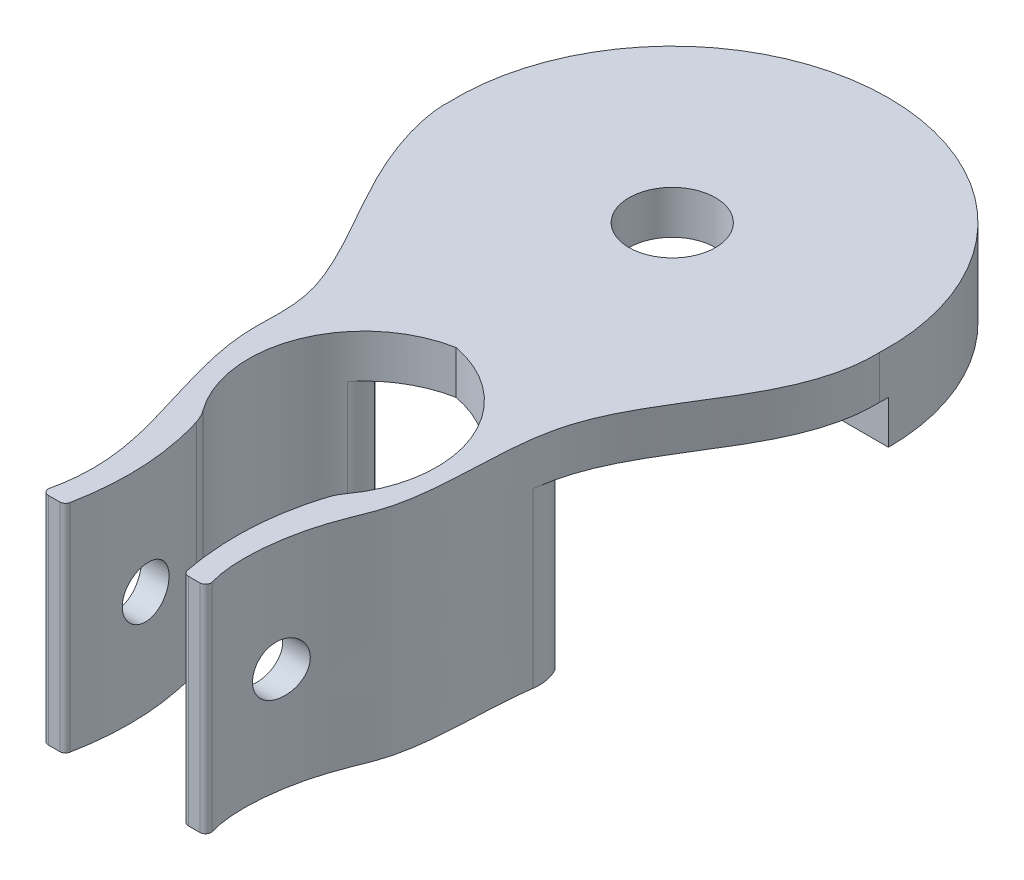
ISO-10303-21;
HEADER;
FILE_DESCRIPTION(('STEP AP214'),'2;1');
FILE_NAME('part.step','',(''),(''),'','','');
FILE_SCHEMA(('AUTOMOTIVE_DESIGN { 1 0 10303 214 1 1 1 1 }'));
ENDSEC;
DATA;
#1=APPLICATION_CONTEXT('core data for automotive mechanical design processes');
#2=APPLICATION_PROTOCOL_DEFINITION('international standard','automotive_design',2000,#1);
#3=PRODUCT_CONTEXT('',#1,'mechanical');
#4=PRODUCT('Part','Part','',(#3));
#5=PRODUCT_RELATED_PRODUCT_CATEGORY('part','',(#4));
#6=PRODUCT_DEFINITION_FORMATION('','',#4);
#7=PRODUCT_DEFINITION_CONTEXT('part definition',#1,'design');
#8=PRODUCT_DEFINITION('design','',#6,#7);
#9=PRODUCT_DEFINITION_SHAPE('','',#8);
#10=(LENGTH_UNIT() NAMED_UNIT(*) SI_UNIT(.MILLI.,.METRE.));
#11=(NAMED_UNIT(*) PLANE_ANGLE_UNIT() SI_UNIT($,.RADIAN.));
#12=(NAMED_UNIT(*) SI_UNIT($,.STERADIAN.) SOLID_ANGLE_UNIT());
#13=UNCERTAINTY_MEASURE_WITH_UNIT(LENGTH_MEASURE(1.E-05),#10,'distance_accuracy_value','');
#14=(GEOMETRIC_REPRESENTATION_CONTEXT(3) GLOBAL_UNCERTAINTY_ASSIGNED_CONTEXT((#13)) GLOBAL_UNIT_ASSIGNED_CONTEXT((#10,
#11,#12)) REPRESENTATION_CONTEXT('',''));
#15=CARTESIAN_POINT('',(0.,0.,0.));
#16=DIRECTION('',(0.,0.,1.));
#17=DIRECTION('',(1.,0.,0.));
#18=AXIS2_PLACEMENT_3D('',#15,#16,#17);
#19=CARTESIAN_POINT('',(-6.93411925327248,0.,15.7482204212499));
#20=DIRECTION('',(0.,-1.,0.));
#21=DIRECTION('',(0.,0.,-1.));
#22=AXIS2_PLACEMENT_3D('',#19,#20,#21);
#23=PLANE('',#22);
#24=CARTESIAN_POINT('',(-5.32844738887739,0.,15.4209148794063));
#25=DIRECTION('',(0.,1.,0.));
#26=DIRECTION('',(0.,0.,-1.));
#27=AXIS2_PLACEMENT_3D('',#24,#25,#26);
#28=CIRCLE('',#27,2.32728935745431);
#29=CARTESIAN_POINT('',(-3.48318439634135,0.,14.0027187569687));
#30=VERTEX_POINT('',#29);
#31=CARTESIAN_POINT('',(-6.74664351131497,0.,13.5756518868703));
#32=VERTEX_POINT('',#31);
#33=EDGE_CURVE('E243',#30,#32,#28,.T.);
#34=ORIENTED_EDGE('',*,*,#33,.F.);
#35=CARTESIAN_POINT('',(-5.96798757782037,0.,13.4760754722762));
#36=DIRECTION('',(0.,-1.,0.));
#37=DIRECTION('',(0.,0.,-1.));
#38=AXIS2_PLACEMENT_3D('',#35,#36,#37);
#39=CIRCLE('',#38,2.54);
#40=CARTESIAN_POINT('',(-3.99843270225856,0.,15.0799624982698));
#41=VERTEX_POINT('',#40);
#42=EDGE_CURVE('E497',#30,#41,#39,.T.);
#43=ORIENTED_EDGE('',*,*,#42,.T.);
#44=CARTESIAN_POINT('',(1.25597785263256,0.,19.3588384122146));
#45=DIRECTION('',(0.,-1.,0.));
#46=DIRECTION('',(0.,0.,1.));
#47=AXIS2_PLACEMENT_3D('',#44,#45,#46);
#48=CIRCLE('',#47,6.77625334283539);
#49=CARTESIAN_POINT('',(-4.21241176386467,0.,23.3606285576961));
#50=VERTEX_POINT('',#49);
#51=EDGE_CURVE('E408',#50,#41,#48,.T.);
#52=ORIENTED_EDGE('',*,*,#51,.F.);
#53=CARTESIAN_POINT('',(-6.26217420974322,0.,24.8606531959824));
#54=DIRECTION('',(0.,1.,0.));
#55=DIRECTION('',(0.,0.,-1.));
#56=AXIS2_PLACEMENT_3D('',#53,#54,#55);
#57=CIRCLE('',#56,2.54);
#58=CARTESIAN_POINT('',(-3.83488723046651,0.,24.1124032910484));
#59=VERTEX_POINT('',#58);
#60=EDGE_CURVE('E403',#59,#50,#57,.T.);
#61=ORIENTED_EDGE('',*,*,#60,.F.);
#62=CARTESIAN_POINT('',(-3.45189480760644,0.,31.932369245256));
#63=CARTESIAN_POINT('',(-3.03837590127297,0.,29.8419376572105));
#64=CARTESIAN_POINT('',(-3.0285914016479,0.,27.2020407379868));
#65=CARTESIAN_POINT('',(-3.6668448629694,0.,24.6575247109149));
#66=CARTESIAN_POINT('',(-3.83488723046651,0.,24.1124032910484));
#67=B_SPLINE_CURVE_WITH_KNOTS('',3,(#62,#63,#64,#65,#66),.UNSPECIFIED.,.F.,.F.,(4,1,4),
(0.0550755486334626,0.772138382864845,0.969570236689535),.UNSPECIFIED.);
#68=CARTESIAN_POINT('',(-3.45189480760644,0.,31.932369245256));
#69=VERTEX_POINT('',#68);
#70=EDGE_CURVE('E399',#69,#59,#67,.T.);
#71=ORIENTED_EDGE('',*,*,#70,.F.);
#72=CARTESIAN_POINT('',(-3.77597646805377,0.,31.8682610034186));
#73=DIRECTION('',(0.,1.,0.));
#74=DIRECTION('',(0.,0.,-1.));
#75=AXIS2_PLACEMENT_3D('',#72,#73,#74);
#76=CIRCLE('',#75,0.330361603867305);
#77=CARTESIAN_POINT('',(-3.77597646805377,0.,32.1986226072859));
#78=VERTEX_POINT('',#77);
#79=EDGE_CURVE('E397',#78,#69,#76,.T.);
#80=ORIENTED_EDGE('',*,*,#79,.F.);
#81=DIRECTION('',(1.,0.,0.));
#82=VECTOR('',#81,1.);
#83=CARTESIAN_POINT('',(-4.45105676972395,0.,32.1986226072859));
#84=LINE('',#83,#82);
#85=CARTESIAN_POINT('',(-4.45105676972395,0.,32.1986226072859));
#86=VERTEX_POINT('',#85);
#87=EDGE_CURVE('E395',#86,#78,#84,.T.);
#88=ORIENTED_EDGE('',*,*,#87,.F.);
#89=CARTESIAN_POINT('',(-4.45105676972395,0.,31.8682610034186));
#90=DIRECTION('',(0.,1.,0.));
#91=DIRECTION('',(0.,0.,1.));
#92=AXIS2_PLACEMENT_3D('',#89,#90,#91);
#93=CIRCLE('',#92,0.330361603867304);
#94=CARTESIAN_POINT('',(-4.77346849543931,0.,31.7962230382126));
#95=VERTEX_POINT('',#94);
#96=EDGE_CURVE('E389',#95,#86,#93,.T.);
#97=ORIENTED_EDGE('',*,*,#96,.F.);
#98=CARTESIAN_POINT('',(-12.6900757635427,0.,0.50197322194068));
#99=CARTESIAN_POINT('',(-12.7085946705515,0.,0.534595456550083));
#100=CARTESIAN_POINT('',(-12.9445111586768,0.,3.81873144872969));
#101=CARTESIAN_POINT('',(-6.44251711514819,0.,13.8864500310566));
#102=CARTESIAN_POINT('',(-7.36026092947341,0.,18.4591788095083));
#103=CARTESIAN_POINT('',(-5.27387900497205,0.,24.7590934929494));
#104=CARTESIAN_POINT('',(-4.15604476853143,0.,29.0328933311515));
#105=CARTESIAN_POINT('',(-4.77346849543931,0.,31.7962230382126));
#106=B_SPLINE_CURVE_WITH_KNOTS('',3,(#98,#99,#100,#101,#102,#103,#104,#105),.UNSPECIFIED.,.F.,
.F.,(4,1,1,1,1,4),(0.,0.279659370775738,0.433863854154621,0.566787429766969,0.759908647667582,
0.988953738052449),.UNSPECIFIED.);
#107=CARTESIAN_POINT('',(-6.99147324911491,0.,15.0107150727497));
#108=VERTEX_POINT('',#107);
#109=EDGE_CURVE('E385',#108,#95,#106,.T.);
#110=ORIENTED_EDGE('',*,*,#109,.F.);
#111=CARTESIAN_POINT('',(-4.47025085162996,0.,14.7024333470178));
#112=DIRECTION('',(0.,-1.,0.));
#113=DIRECTION('',(0.,0.,-1.));
#114=AXIS2_PLACEMENT_3D('',#111,#112,#113);
#115=CIRCLE('',#114,2.54);
#116=EDGE_CURVE('E492',#108,#32,#115,.T.);
#117=ORIENTED_EDGE('',*,*,#116,.T.);
#118=EDGE_LOOP('',(#34,#43,#52,#61,#71,#80,#88,#97,#110,#117));
#119=FACE_BOUND('',#118,.T.);
#120=ADVANCED_FACE('F33',(#119),#23,.T.);
#121=CARTESIAN_POINT('',(0.,10.16,0.));
#122=DIRECTION('',(0.,1.,0.));
#123=DIRECTION('',(0.,0.,1.));
#124=AXIS2_PLACEMENT_3D('',#121,#122,#123);
#125=PLANE('',#124);
#126=CARTESIAN_POINT('',(4.38720927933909,10.16,14.7274262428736));
#127=DIRECTION('',(0.,1.,0.));
#128=DIRECTION('',(0.,0.,1.));
#129=AXIS2_PLACEMENT_3D('',#126,#127,#128);
#130=CIRCLE('',#129,2.54);
#131=CARTESIAN_POINT('',(6.90221502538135,10.16,15.0828782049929));
#132=VERTEX_POINT('',#131);
#133=CARTESIAN_POINT('',(6.59220879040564,10.16,13.4666419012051));
#134=VERTEX_POINT('',#133);
#135=EDGE_CURVE('E231',#132,#134,#130,.T.);
#136=ORIENTED_EDGE('',*,*,#135,.T.);
#137=CARTESIAN_POINT('',(5.32844738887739,10.16,15.4209148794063));
#138=DIRECTION('',(0.,1.,0.));
#139=DIRECTION('',(0.,0.,1.));
#140=AXIS2_PLACEMENT_3D('',#137,#138,#139);
#141=CIRCLE('',#140,2.32728935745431);
#142=CARTESIAN_POINT('',(3.48318439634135,10.16,14.0027187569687));
#143=VERTEX_POINT('',#142);
#144=EDGE_CURVE('E226',#134,#143,#141,.T.);
#145=ORIENTED_EDGE('',*,*,#144,.T.);
#146=CARTESIAN_POINT('',(5.01136367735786,10.16,12.9978991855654));
#147=DIRECTION('',(0.,-1.,0.));
#148=DIRECTION('',(0.,0.,1.));
#149=AXIS2_PLACEMENT_3D('',#146,#147,#148);
#150=CIRCLE('',#149,1.82893255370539);
#151=CARTESIAN_POINT('',(3.4432980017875,10.16,13.9392621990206));
#152=VERTEX_POINT('',#151);
#153=EDGE_CURVE('E48',#143,#152,#150,.T.);
#154=ORIENTED_EDGE('',*,*,#153,.T.);
#155=CARTESIAN_POINT('',(5.93221528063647,10.16,13.4324182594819));
#156=DIRECTION('',(0.,1.,0.));
#157=DIRECTION('',(0.,0.,1.));
#158=AXIS2_PLACEMENT_3D('',#155,#156,#157);
#159=CIRCLE('',#158,2.54);
#160=CARTESIAN_POINT('',(3.97241342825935,10.16,15.0482080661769));
#161=VERTEX_POINT('',#160);
#162=EDGE_CURVE('E509',#152,#161,#159,.T.);
#163=ORIENTED_EDGE('',*,*,#162,.T.);
#164=CARTESIAN_POINT('',(-1.25597785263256,10.16,19.3588384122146));
#165=DIRECTION('',(0.,1.,0.));
#166=DIRECTION('',(0.,0.,1.));
#167=AXIS2_PLACEMENT_3D('',#164,#165,#166);
#168=CIRCLE('',#167,6.77625334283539);
#169=CARTESIAN_POINT('',(0.,10.16,12.7));
#170=VERTEX_POINT('',#169);
#171=EDGE_CURVE('E511',#170,#161,#168,.F.);
#172=ORIENTED_EDGE('',*,*,#171,.F.);
#173=CARTESIAN_POINT('',(1.25597785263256,10.16,19.3588384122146));
#174=DIRECTION('',(0.,1.,0.));
#175=DIRECTION('',(0.,0.,1.));
#176=AXIS2_PLACEMENT_3D('',#173,#174,#175);
#177=CIRCLE('',#176,6.77625334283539);
#178=CARTESIAN_POINT('',(-3.99843270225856,10.16,15.0799624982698));
#179=VERTEX_POINT('',#178);
#180=EDGE_CURVE('E520',#179,#170,#177,.F.);
#181=ORIENTED_EDGE('',*,*,#180,.F.);
#182=CARTESIAN_POINT('',(-5.96798757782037,10.16,13.4760754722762));
#183=DIRECTION('',(0.,1.,0.));
#184=DIRECTION('',(0.,0.,1.));
#185=AXIS2_PLACEMENT_3D('',#182,#183,#184);
#186=CIRCLE('',#185,2.54);
#187=CARTESIAN_POINT('',(-3.48318439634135,10.16,14.0027187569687));
#188=VERTEX_POINT('',#187);
#189=EDGE_CURVE('E507',#179,#188,#186,.T.);
#190=ORIENTED_EDGE('',*,*,#189,.T.);
#191=CARTESIAN_POINT('',(-5.32844738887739,10.16,15.4209148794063));
#192=DIRECTION('',(0.,1.,0.));
#193=DIRECTION('',(0.,0.,-1.));
#194=AXIS2_PLACEMENT_3D('',#191,#192,#193);
#195=CIRCLE('',#194,2.32728935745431);
#196=CARTESIAN_POINT('',(-6.74664351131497,10.16,13.5756518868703));
#197=VERTEX_POINT('',#196);
#198=EDGE_CURVE('E252',#188,#197,#195,.T.);
#199=ORIENTED_EDGE('',*,*,#198,.T.);
#200=CARTESIAN_POINT('',(-4.47025085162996,10.16,14.7024333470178));
#201=DIRECTION('',(0.,1.,0.));
#202=DIRECTION('',(0.,0.,1.));
#203=AXIS2_PLACEMENT_3D('',#200,#201,#202);
#204=CIRCLE('',#203,2.54);
#205=CARTESIAN_POINT('',(-6.99147324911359,10.16,15.0107150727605));
#206=VERTEX_POINT('',#205);
#207=EDGE_CURVE('E495',#197,#206,#204,.T.);
#208=ORIENTED_EDGE('',*,*,#207,.T.);
#209=CARTESIAN_POINT('',(-12.6900757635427,10.16,0.50197322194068));
#210=CARTESIAN_POINT('',(-12.7085946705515,10.16,0.534595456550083));
#211=CARTESIAN_POINT('',(-12.9445111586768,10.16,3.81873144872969));
#212=CARTESIAN_POINT('',(-6.44251711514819,10.16,13.8864500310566));
#213=CARTESIAN_POINT('',(-7.36026092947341,10.16,18.4591788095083));
#214=CARTESIAN_POINT('',(-5.27387900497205,10.16,24.7590934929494));
#215=CARTESIAN_POINT('',(-4.15604476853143,10.16,29.0328933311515));
#216=CARTESIAN_POINT('',(-4.77346849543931,10.16,31.7962230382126));
#217=B_SPLINE_CURVE_WITH_KNOTS('',3,(#209,#210,#211,#212,#213,#214,#215,#216),.UNSPECIFIED.,.F.,
.F.,(4,1,1,1,1,4),(0.,0.279659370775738,0.433863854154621,0.566787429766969,0.759908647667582,
0.988953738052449),.UNSPECIFIED.);
#218=CARTESIAN_POINT('',(-12.6900757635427,10.16,0.501973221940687));
#219=VERTEX_POINT('',#218);
#220=EDGE_CURVE('E521',#219,#206,#217,.T.);
#221=ORIENTED_EDGE('',*,*,#220,.F.);
#222=CARTESIAN_POINT('',(0.,10.16,0.));
#223=DIRECTION('',(0.,1.,0.));
#224=DIRECTION('',(0.,0.,1.));
#225=AXIS2_PLACEMENT_3D('',#222,#223,#224);
#226=CIRCLE('',#225,12.7);
#227=CARTESIAN_POINT('',(-12.7,10.16,0.));
#228=VERTEX_POINT('',#227);
#229=EDGE_CURVE('E484',#228,#219,#226,.T.);
#230=ORIENTED_EDGE('',*,*,#229,.F.);
#231=DIRECTION('',(1.,0.,0.));
#232=VECTOR('',#231,1.);
#233=CARTESIAN_POINT('',(0.,10.16,2.06928460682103E-13));
#234=LINE('',#233,#232);
#235=CARTESIAN_POINT('',(-8.89000000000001,10.16,0.));
#236=VERTEX_POINT('',#235);
#237=EDGE_CURVE('E285',#228,#236,#234,.T.);
#238=ORIENTED_EDGE('',*,*,#237,.T.);
#239=DIRECTION('',(0.,0.,-1.));
#240=VECTOR('',#239,1.);
#241=CARTESIAN_POINT('',(-8.89000000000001,10.16,0.));
#242=LINE('',#241,#240);
#243=CARTESIAN_POINT('',(-8.89,10.16,-9.06961410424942));
#244=VERTEX_POINT('',#243);
#245=EDGE_CURVE('E280',#236,#244,#242,.T.);
#246=ORIENTED_EDGE('',*,*,#245,.T.);
#247=CARTESIAN_POINT('',(8.89,10.16,-9.06961410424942));
#248=VERTEX_POINT('',#247);
#249=EDGE_CURVE('E627',#248,#244,#226,.T.);
#250=ORIENTED_EDGE('',*,*,#249,.F.);
#251=DIRECTION('',(0.,0.,-1.));
#252=VECTOR('',#251,1.);
#253=CARTESIAN_POINT('',(8.89000000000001,10.16,0.));
#254=LINE('',#253,#252);
#255=CARTESIAN_POINT('',(8.89000000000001,10.16,0.));
#256=VERTEX_POINT('',#255);
#257=EDGE_CURVE('E55',#256,#248,#254,.T.);
#258=ORIENTED_EDGE('',*,*,#257,.F.);
#259=DIRECTION('',(-1.,0.,0.));
#260=VECTOR('',#259,1.);
#261=CARTESIAN_POINT('',(0.,10.16,0.));
#262=LINE('',#261,#260);
#263=CARTESIAN_POINT('',(12.7,10.16,0.));
#264=VERTEX_POINT('',#263);
#265=EDGE_CURVE('E260',#264,#256,#262,.T.);
#266=ORIENTED_EDGE('',*,*,#265,.F.);
#267=CARTESIAN_POINT('',(12.6900757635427,10.16,0.501973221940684));
#268=VERTEX_POINT('',#267);
#269=EDGE_CURVE('E345',#268,#264,#226,.T.);
#270=ORIENTED_EDGE('',*,*,#269,.F.);
#271=CARTESIAN_POINT('',(4.77346849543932,10.16,31.7962230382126));
#272=CARTESIAN_POINT('',(4.26261652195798,10.16,30.1479997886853));
#273=CARTESIAN_POINT('',(4.52523901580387,10.16,26.6602313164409));
#274=CARTESIAN_POINT('',(7.08560364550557,10.16,20.9954102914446));
#275=CARTESIAN_POINT('',(5.48854782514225,10.16,11.2875043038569));
#276=CARTESIAN_POINT('',(12.8342449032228,10.16,5.63803468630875));
#277=CARTESIAN_POINT('',(12.6900757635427,10.16,0.501973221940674));
#278=B_SPLINE_CURVE_WITH_KNOTS('',3,(#271,#272,#273,#274,#275,#276,#277),.UNSPECIFIED.,.F.,.F.,
(4,1,1,1,4),(0.,0.239032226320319,0.296991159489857,0.579589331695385,1.),.UNSPECIFIED.);
#279=EDGE_CURVE('E614',#132,#268,#278,.T.);
#280=ORIENTED_EDGE('',*,*,#279,.F.);
#281=EDGE_LOOP('',(#136,#145,#154,#163,#172,#181,#190,#199,#208,#221,#230,#238,#246,#250,#258,
#266,#270,#280));
#282=FACE_BOUND('',#281,.T.);
#283=CARTESIAN_POINT('',(0.,10.16,0.));
#284=DIRECTION('',(0.,1.,0.));
#285=DIRECTION('',(0.,0.,1.));
#286=AXIS2_PLACEMENT_3D('',#283,#284,#285);
#287=CIRCLE('',#286,2.54);
#288=CARTESIAN_POINT('',(0.,10.16,2.54));
#289=VERTEX_POINT('',#288);
#290=EDGE_CURVE('E344',#289,#289,#287,.T.);
#291=ORIENTED_EDGE('',*,*,#290,.T.);
#292=EDGE_LOOP('',(#291));
#293=FACE_BOUND('',#292,.T.);
#294=ADVANCED_FACE('F228',(#282,#293),#125,.F.);
#295=CARTESIAN_POINT('',(-12.6900757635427,12.7,0.50197322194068));
#296=CARTESIAN_POINT('',(-12.7085946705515,12.7,0.534595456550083));
#297=CARTESIAN_POINT('',(-12.9445111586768,12.7,3.81873144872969));
#298=CARTESIAN_POINT('',(-6.44251711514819,12.7,13.8864500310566));
#299=CARTESIAN_POINT('',(-7.36026092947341,12.7,18.4591788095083));
#300=CARTESIAN_POINT('',(-5.27387900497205,12.7,24.7590934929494));
#301=CARTESIAN_POINT('',(-4.15604476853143,12.7,29.0328933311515));
#302=CARTESIAN_POINT('',(-4.77346849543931,12.7,31.7962230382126));
#303=B_SPLINE_CURVE_WITH_KNOTS('',3,(#295,#296,#297,#298,#299,#300,#301,#302),.UNSPECIFIED.,.F.,
.F.,(4,1,1,1,1,4),(0.,0.279659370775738,0.433863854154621,0.566787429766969,0.759908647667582,
0.988953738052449),.UNSPECIFIED.);
#304=DIRECTION('',(0.,-1.,0.));
#305=VECTOR('',#304,1.);
#306=SURFACE_OF_LINEAR_EXTRUSION('',#303,#305);
#307=CARTESIAN_POINT('',(-4.95633280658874,6.16582696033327,26.2198274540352));
#308=CARTESIAN_POINT('',(-4.95633093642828,6.24700173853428,26.2198332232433));
#309=CARTESIAN_POINT('',(-4.95468988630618,6.32825554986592,26.2265713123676));
#310=CARTESIAN_POINT('',(-4.94984501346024,6.44829752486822,26.2465882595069));
#311=CARTESIAN_POINT('',(-4.94783030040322,6.48803576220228,26.2549227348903));
#312=CARTESIAN_POINT('',(-4.94303519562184,6.56668331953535,26.2748321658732));
#313=CARTESIAN_POINT('',(-4.94025417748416,6.60559193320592,26.2864097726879));
#314=CARTESIAN_POINT('',(-4.93082928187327,6.72045100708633,26.3258242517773));
#315=CARTESIAN_POINT('',(-4.92309473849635,6.79474723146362,26.3583785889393));
#316=CARTESIAN_POINT('',(-4.90513999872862,6.93677734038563,26.4350646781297));
#317=CARTESIAN_POINT('',(-4.89491932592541,7.00450996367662,26.4791986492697));
#318=CARTESIAN_POINT('',(-4.8780643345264,7.10031269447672,26.5534114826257));
#319=CARTESIAN_POINT('',(-4.87214051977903,7.13149723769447,26.5797179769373));
#320=CARTESIAN_POINT('',(-4.85988117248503,7.19150813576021,26.6347494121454));
#321=CARTESIAN_POINT('',(-4.85354604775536,7.22033676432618,26.6634719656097));
#322=CARTESIAN_POINT('',(-4.83403048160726,7.3030778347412,26.7530398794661));
#323=CARTESIAN_POINT('',(-4.82033748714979,7.35325866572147,26.8172957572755));
#324=CARTESIAN_POINT('',(-4.79194668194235,7.44340495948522,26.954756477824));
#325=CARTESIAN_POINT('',(-4.77723230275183,7.48308343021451,27.0281449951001));
#326=CARTESIAN_POINT('',(-4.7478441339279,7.54952543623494,27.1805759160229));
#327=CARTESIAN_POINT('',(-4.73317034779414,7.57628789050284,27.2596187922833));
#328=CARTESIAN_POINT('',(-4.70439156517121,7.61634436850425,27.4221089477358));
#329=CARTESIAN_POINT('',(-4.69029466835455,7.62948593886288,27.5055953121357));
#330=CARTESIAN_POINT('',(-4.66344952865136,7.64131172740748,27.6738028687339));
#331=CARTESIAN_POINT('',(-4.6507012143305,7.6399967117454,27.7585239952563));
#332=CARTESIAN_POINT('',(-4.62710919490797,7.62290283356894,27.9259812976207));
#333=CARTESIAN_POINT('',(-4.61624936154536,7.60725441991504,28.0087284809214));
#334=CARTESIAN_POINT('',(-4.59654475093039,7.56201088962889,28.1705694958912));
#335=CARTESIAN_POINT('',(-4.5876997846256,7.53241708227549,28.249663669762));
#336=CARTESIAN_POINT('',(-4.57219484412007,7.46064779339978,28.4005773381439));
#337=CARTESIAN_POINT('',(-4.56550202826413,7.41868223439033,28.4724933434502));
#338=CARTESIAN_POINT('',(-4.55397270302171,7.32316274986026,28.6083335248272));
#339=CARTESIAN_POINT('',(-4.54913611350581,7.26960932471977,28.6722580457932));
#340=CARTESIAN_POINT('',(-4.54107983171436,7.15291119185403,28.7897424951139));
#341=CARTESIAN_POINT('',(-4.53784746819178,7.0898469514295,28.8433815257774));
#342=CARTESIAN_POINT('',(-4.53260550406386,6.9556019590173,28.9393752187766));
#343=CARTESIAN_POINT('',(-4.53059590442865,6.88442120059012,28.9817298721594));
#344=CARTESIAN_POINT('',(-4.52746056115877,6.73592427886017,29.0539565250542));
#345=CARTESIAN_POINT('',(-4.52633526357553,6.65860504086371,29.0838222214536));
#346=CARTESIAN_POINT('',(-4.52469256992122,6.50005194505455,29.1301893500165));
#347=CARTESIAN_POINT('',(-4.52417517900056,6.41881805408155,29.1466906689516));
#348=CARTESIAN_POINT('',(-4.5235805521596,6.25457859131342,29.1658783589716));
#349=CARTESIAN_POINT('',(-4.52350414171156,6.17156998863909,29.1685388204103));
#350=CARTESIAN_POINT('',(-4.52376568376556,6.0062827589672,29.1598991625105));
#351=CARTESIAN_POINT('',(-4.52410363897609,5.92400413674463,29.1485989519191));
#352=CARTESIAN_POINT('',(-4.52531127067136,5.76247392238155,29.1123509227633));
#353=CARTESIAN_POINT('',(-4.52618119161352,5.68322373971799,29.0873968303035));
#354=CARTESIAN_POINT('',(-4.52869534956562,5.53004418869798,29.0245498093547));
#355=CARTESIAN_POINT('',(-4.53033958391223,5.45611480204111,28.9866569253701));
#356=CARTESIAN_POINT('',(-4.5347255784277,5.315737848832,28.8990565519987));
#357=CARTESIAN_POINT('',(-4.53746648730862,5.24928453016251,28.8493582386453));
#358=CARTESIAN_POINT('',(-4.54439265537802,5.12568716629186,28.7395737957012));
#359=CARTESIAN_POINT('',(-4.54857787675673,5.0685428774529,28.6794879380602));
#360=CARTESIAN_POINT('',(-4.55868346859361,4.96528612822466,28.5508211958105));
#361=CARTESIAN_POINT('',(-4.5646002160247,4.91915099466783,28.4822582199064));
#362=CARTESIAN_POINT('',(-4.57836141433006,4.83902980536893,28.3385472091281));
#363=CARTESIAN_POINT('',(-4.58620583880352,4.80504358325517,28.2633992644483));
#364=CARTESIAN_POINT('',(-4.60386021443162,4.75008054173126,28.1086349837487));
#365=CARTESIAN_POINT('',(-4.61367186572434,4.72911503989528,28.0290148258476));
#366=CARTESIAN_POINT('',(-4.63510249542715,4.70071797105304,27.8676361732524));
#367=CARTESIAN_POINT('',(-4.64672157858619,4.69328718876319,27.7858775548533));
#368=CARTESIAN_POINT('',(-4.67156280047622,4.69204470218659,27.6216286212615));
#369=CARTESIAN_POINT('',(-4.6848003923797,4.69837582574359,27.5391395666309));
#370=CARTESIAN_POINT('',(-4.71227529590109,4.72466608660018,27.3765440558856));
#371=CARTESIAN_POINT('',(-4.72651271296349,4.74462666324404,27.2964378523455));
#372=CARTESIAN_POINT('',(-4.75560874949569,4.79804313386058,27.1394370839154));
#373=CARTESIAN_POINT('',(-4.77047368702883,4.83171169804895,27.0626152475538));
#374=CARTESIAN_POINT('',(-4.79250147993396,4.89156529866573,26.9525368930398));
#375=CARTESIAN_POINT('',(-4.79980055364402,4.91308011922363,26.9166966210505));
#376=CARTESIAN_POINT('',(-4.81422874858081,4.95911590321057,26.8469095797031));
#377=CARTESIAN_POINT('',(-4.82135768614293,4.98363995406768,26.8129648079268));
#378=CARTESIAN_POINT('',(-4.84240612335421,5.06173030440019,26.714069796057));
#379=CARTESIAN_POINT('',(-4.85592141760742,5.11963802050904,26.6523839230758));
#380=CARTESIAN_POINT('',(-4.88109901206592,5.24537960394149,26.5396758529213));
#381=CARTESIAN_POINT('',(-4.89276166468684,5.31321157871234,26.4886516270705));
#382=CARTESIAN_POINT('',(-4.908284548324,5.42040035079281,26.4216479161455));
#383=CARTESIAN_POINT('',(-4.91310441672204,5.45677478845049,26.4010094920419));
#384=CARTESIAN_POINT('',(-4.92206046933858,5.53117479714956,26.3628837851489));
#385=CARTESIAN_POINT('',(-4.92619724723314,5.56919889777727,26.3453937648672));
#386=CARTESIAN_POINT('',(-4.93748410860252,5.68533852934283,26.2978861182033));
#387=CARTESIAN_POINT('',(-4.94352972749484,5.76565119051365,26.2727497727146));
#388=CARTESIAN_POINT('',(-4.95069263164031,5.89970092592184,26.2430743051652));
#389=CARTESIAN_POINT('',(-4.95280201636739,5.95251744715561,26.2343717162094));
#390=CARTESIAN_POINT('',(-4.95562270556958,6.05882018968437,26.2227464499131));
#391=CARTESIAN_POINT('',(-4.95633403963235,6.11230639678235,26.2198236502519));
#392=CARTESIAN_POINT('',(-4.95633280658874,6.16582696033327,26.2198274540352));
#393=B_SPLINE_CURVE_WITH_KNOTS('',3,(#307,#308,#309,#310,#311,#312,#313,#314,#315,#316,#317,
#318,#319,#320,#321,#322,#323,#324,#325,#326,#327,#328,#329,#330,#331,#332,#333,#334,#335,#336,
#337,#338,#339,#340,#341,#342,#343,#344,#345,#346,#347,#348,#349,#350,#351,#352,#353,#354,#355,
#356,#357,#358,#359,#360,#361,#362,#363,#364,#365,#366,#367,#368,#369,#370,#371,#372,#373,#374,
#375,#376,#377,#378,#379,#380,#381,#382,#383,#384,#385,#386,#387,#388,#389,#390,#391,#392),
.UNSPECIFIED.,.T.,.F.,(4,2,2,2,2,2,2,2,2,2,2,2,2,2,2,2,2,2,2,2,2,2,2,2,2,2,2,2,2,2,2,2,2,2,2,2,
2,2,2,2,2,2,4),(0.,0.24329340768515,0.365133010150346,0.487072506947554,0.730312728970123,
0.973599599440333,1.09715425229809,1.2205882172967,1.46740609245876,1.7203991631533,
1.97341340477,2.22922992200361,2.48503288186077,2.73853065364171,2.99200463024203,
3.24140354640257,3.49079169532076,3.73817734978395,3.98556320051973,4.23307375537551,
4.48058640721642,4.72856222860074,4.97653967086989,5.22463115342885,5.47272178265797,
5.72062020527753,5.96851213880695,6.21588904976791,6.46326257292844,6.71085081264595,
6.95845340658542,7.20863800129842,7.4588490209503,7.71309952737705,7.84027490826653,
7.96758187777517,8.22330883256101,8.47898708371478,8.60514352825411,8.73118974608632,
8.98282541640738,9.14323824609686,9.30364768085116),.UNSPECIFIED.);
#394=CARTESIAN_POINT('',(-4.95633280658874,6.16582696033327,26.2198274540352));
#395=VERTEX_POINT('',#394);
#396=EDGE_CURVE('E302',#395,#395,#393,.T.);
#397=ORIENTED_EDGE('',*,*,#396,.T.);
#398=EDGE_LOOP('',(#397));
#399=FACE_BOUND('',#398,.T.);
#400=ORIENTED_EDGE('',*,*,#220,.T.);
#401=DIRECTION('',(0.,-1.,0.));
#402=VECTOR('',#401,1.);
#403=CARTESIAN_POINT('',(-6.99147324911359,10.16,15.0107150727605));
#404=LINE('',#403,#402);
#405=EDGE_CURVE('E490',#206,#108,#404,.T.);
#406=ORIENTED_EDGE('',*,*,#405,.T.);
#407=ORIENTED_EDGE('',*,*,#109,.T.);
#408=DIRECTION('',(0.,-1.,0.));
#409=VECTOR('',#408,1.);
#410=CARTESIAN_POINT('',(-4.77346849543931,12.7,31.7962230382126));
#411=LINE('',#410,#409);
#412=CARTESIAN_POINT('',(-4.77346849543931,12.7,31.7962230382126));
#413=VERTEX_POINT('',#412);
#414=EDGE_CURVE('E478',#413,#95,#411,.T.);
#415=ORIENTED_EDGE('',*,*,#414,.F.);
#416=CARTESIAN_POINT('',(-12.6900757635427,12.7,0.501973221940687));
#417=VERTEX_POINT('',#416);
#418=EDGE_CURVE('E433',#417,#413,#303,.T.);
#419=ORIENTED_EDGE('',*,*,#418,.F.);
#420=DIRECTION('',(0.,-1.,0.));
#421=VECTOR('',#420,1.);
#422=CARTESIAN_POINT('',(-12.6900757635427,12.7,0.501973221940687));
#423=LINE('',#422,#421);
#424=EDGE_CURVE('E384',#417,#219,#423,.T.);
#425=ORIENTED_EDGE('',*,*,#424,.T.);
#426=EDGE_LOOP('',(#400,#406,#407,#415,#419,#425));
#427=FACE_BOUND('',#426,.T.);
#428=ADVANCED_FACE('F569',(#399,#427),#306,.F.);
#429=CARTESIAN_POINT('',(1.25597785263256,12.7,19.3588384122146));
#430=DIRECTION('',(0.,-1.,0.));
#431=DIRECTION('',(0.,0.,-1.));
#432=AXIS2_PLACEMENT_3D('',#429,#430,#431);
#433=CYLINDRICAL_SURFACE('',#432,6.77625334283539);
#434=ORIENTED_EDGE('',*,*,#51,.T.);
#435=DIRECTION('',(0.,-1.,0.));
#436=VECTOR('',#435,1.);
#437=CARTESIAN_POINT('',(-3.99843270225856,12.7,15.0799624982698));
#438=LINE('',#437,#436);
#439=EDGE_CURVE('E499',#41,#179,#438,.F.);
#440=ORIENTED_EDGE('',*,*,#439,.T.);
#441=ORIENTED_EDGE('',*,*,#180,.T.);
#442=DIRECTION('',(0.,-1.,0.));
#443=VECTOR('',#442,1.);
#444=CARTESIAN_POINT('',(0.,12.7,12.7));
#445=LINE('',#444,#443);
#446=CARTESIAN_POINT('',(0.,12.7,12.7));
#447=VERTEX_POINT('',#446);
#448=EDGE_CURVE('E460',#447,#170,#445,.T.);
#449=ORIENTED_EDGE('',*,*,#448,.F.);
#450=CARTESIAN_POINT('',(1.25597785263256,12.7,19.3588384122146));
#451=DIRECTION('',(0.,-1.,0.));
#452=DIRECTION('',(0.,0.,1.));
#453=AXIS2_PLACEMENT_3D('',#450,#451,#452);
#454=CIRCLE('',#453,6.77625334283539);
#455=CARTESIAN_POINT('',(-4.21241176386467,12.7,23.3606285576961));
#456=VERTEX_POINT('',#455);
#457=EDGE_CURVE('E535',#456,#447,#454,.T.);
#458=ORIENTED_EDGE('',*,*,#457,.F.);
#459=DIRECTION('',(0.,-1.,0.));
#460=VECTOR('',#459,1.);
#461=CARTESIAN_POINT('',(-4.21241176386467,12.7,23.3606285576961));
#462=LINE('',#461,#460);
#463=EDGE_CURVE('E463',#456,#50,#462,.T.);
#464=ORIENTED_EDGE('',*,*,#463,.T.);
#465=EDGE_LOOP('',(#434,#440,#441,#449,#458,#464));
#466=FACE_BOUND('',#465,.T.);
#467=ADVANCED_FACE('F574',(#466),#433,.F.);
#468=CARTESIAN_POINT('',(-1.25597785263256,12.7,19.3588384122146));
#469=DIRECTION('',(0.,-1.,0.));
#470=DIRECTION('',(0.,0.,-1.));
#471=AXIS2_PLACEMENT_3D('',#468,#469,#470);
#472=CYLINDRICAL_SURFACE('',#471,6.77625334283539);
#473=ORIENTED_EDGE('',*,*,#171,.T.);
#474=DIRECTION('',(0.,-1.,0.));
#475=VECTOR('',#474,1.);
#476=CARTESIAN_POINT('',(3.97241342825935,12.7,15.0482080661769));
#477=LINE('',#476,#475);
#478=CARTESIAN_POINT('',(3.97241342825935,0.,15.0482080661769));
#479=VERTEX_POINT('',#478);
#480=EDGE_CURVE('E502',#161,#479,#477,.T.);
#481=ORIENTED_EDGE('',*,*,#480,.T.);
#482=CARTESIAN_POINT('',(-1.25597785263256,0.,19.3588384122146));
#483=DIRECTION('',(0.,-1.,0.));
#484=DIRECTION('',(0.,0.,-1.));
#485=AXIS2_PLACEMENT_3D('',#482,#483,#484);
#486=CIRCLE('',#485,6.77625334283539);
#487=CARTESIAN_POINT('',(4.21241176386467,0.,23.3606285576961));
#488=VERTEX_POINT('',#487);
#489=EDGE_CURVE('E411',#479,#488,#486,.T.);
#490=ORIENTED_EDGE('',*,*,#489,.T.);
#491=DIRECTION('',(0.,-1.,0.));
#492=VECTOR('',#491,1.);
#493=CARTESIAN_POINT('',(4.21241176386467,12.7,23.3606285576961));
#494=LINE('',#493,#492);
#495=CARTESIAN_POINT('',(4.21241176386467,12.7,23.3606285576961));
#496=VERTEX_POINT('',#495);
#497=EDGE_CURVE('E457',#496,#488,#494,.T.);
#498=ORIENTED_EDGE('',*,*,#497,.F.);
#499=CARTESIAN_POINT('',(-1.25597785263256,12.7,19.3588384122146));
#500=DIRECTION('',(0.,-1.,0.));
#501=DIRECTION('',(0.,0.,-1.));
#502=AXIS2_PLACEMENT_3D('',#499,#500,#501);
#503=CIRCLE('',#502,6.77625334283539);
#504=EDGE_CURVE('E534',#447,#496,#503,.T.);
#505=ORIENTED_EDGE('',*,*,#504,.F.);
#506=ORIENTED_EDGE('',*,*,#448,.T.);
#507=EDGE_LOOP('',(#473,#481,#490,#498,#505,#506));
#508=FACE_BOUND('',#507,.T.);
#509=ADVANCED_FACE('F516',(#508),#472,.F.);
#510=CARTESIAN_POINT('',(4.77346849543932,12.7,31.7962230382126));
#511=CARTESIAN_POINT('',(4.26261652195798,12.7,30.1479997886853));
#512=CARTESIAN_POINT('',(4.52523901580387,12.7,26.6602313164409));
#513=CARTESIAN_POINT('',(7.08560364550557,12.7,20.9954102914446));
#514=CARTESIAN_POINT('',(5.48854782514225,12.7,11.2875043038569));
#515=CARTESIAN_POINT('',(12.8342449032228,12.7,5.63803468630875));
#516=CARTESIAN_POINT('',(12.6900757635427,12.7,0.501973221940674));
#517=B_SPLINE_CURVE_WITH_KNOTS('',3,(#510,#511,#512,#513,#514,#515,#516),.UNSPECIFIED.,.F.,.F.,
(4,1,1,1,4),(0.,0.239032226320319,0.296991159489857,0.579589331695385,1.),.UNSPECIFIED.);
#518=DIRECTION('',(0.,-1.,0.));
#519=VECTOR('',#518,1.);
#520=SURFACE_OF_LINEAR_EXTRUSION('',#517,#519);
#521=CARTESIAN_POINT('',(4.95845871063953,6.16582696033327,26.2198274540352));
#522=CARTESIAN_POINT('',(4.95845648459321,6.08479950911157,26.2198332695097));
#523=CARTESIAN_POINT('',(4.95671313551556,6.00369267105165,26.2265473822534));
#524=CARTESIAN_POINT('',(4.9515812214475,5.88387338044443,26.2464895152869));
#525=CARTESIAN_POINT('',(4.94944838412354,5.84420943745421,26.2547926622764));
#526=CARTESIAN_POINT('',(4.94438042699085,5.76571085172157,26.274625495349));
#527=CARTESIAN_POINT('',(4.94144465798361,5.72687690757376,26.2861577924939));
#528=CARTESIAN_POINT('',(4.93151565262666,5.61225019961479,26.3254107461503));
#529=CARTESIAN_POINT('',(4.92339080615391,5.53810931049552,26.3578250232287));
#530=CARTESIAN_POINT('',(4.90463187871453,5.39635927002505,26.4341701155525));
#531=CARTESIAN_POINT('',(4.89399726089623,5.32875152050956,26.478103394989));
#532=CARTESIAN_POINT('',(4.87654497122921,5.23301634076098,26.5520403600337));
#533=CARTESIAN_POINT('',(4.87041646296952,5.20180090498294,26.5782942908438));
#534=CARTESIAN_POINT('',(4.85776718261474,5.14172291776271,26.6332234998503));
#535=CARTESIAN_POINT('',(4.85124680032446,5.11285809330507,26.6618963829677));
#536=CARTESIAN_POINT('',(4.83121393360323,5.02999863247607,26.7513227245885));
#537=CARTESIAN_POINT('',(4.81722734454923,4.97972615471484,26.8154938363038));
#538=CARTESIAN_POINT('',(4.78834285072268,4.88930263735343,26.952922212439));
#539=CARTESIAN_POINT('',(4.77343060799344,4.84945588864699,27.0263755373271));
#540=CARTESIAN_POINT('',(4.74375116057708,4.78270859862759,27.1789889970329));
#541=CARTESIAN_POINT('',(4.72898396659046,4.75580900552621,27.2581495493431));
#542=CARTESIAN_POINT('',(4.70008899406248,4.71555381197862,27.4207926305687));
#543=CARTESIAN_POINT('',(4.68596872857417,4.70233092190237,27.5043093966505));
#544=CARTESIAN_POINT('',(4.65905230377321,4.69035619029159,27.6725875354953));
#545=CARTESIAN_POINT('',(4.64625607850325,4.6916036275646,27.7573488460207));
#546=CARTESIAN_POINT('',(4.62248192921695,4.7085721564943,27.9248639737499));
#547=CARTESIAN_POINT('',(4.61148826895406,4.7241591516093,28.0076291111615));
#548=CARTESIAN_POINT('',(4.59139006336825,4.76927992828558,28.1695070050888));
#549=CARTESIAN_POINT('',(4.58228535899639,4.79881253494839,28.2486200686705));
#550=CARTESIAN_POINT('',(4.56613190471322,4.87050792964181,28.3996769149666));
#551=CARTESIAN_POINT('',(4.55905473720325,4.91247744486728,28.4717094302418));
#552=CARTESIAN_POINT('',(4.5466782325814,5.00803989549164,28.6077719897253));
#553=CARTESIAN_POINT('',(4.54137881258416,5.06163228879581,28.6718024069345));
#554=CARTESIAN_POINT('',(4.53238140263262,5.17843369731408,28.7894713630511));
#555=CARTESIAN_POINT('',(4.52867064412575,5.24156030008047,28.8431907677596));
#556=CARTESIAN_POINT('',(4.52251523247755,5.37595870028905,28.9393228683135));
#557=CARTESIAN_POINT('',(4.52007057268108,5.44723045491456,28.9817356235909));
#558=CARTESIAN_POINT('',(4.51616716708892,5.59583696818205,29.0540018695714));
#559=CARTESIAN_POINT('',(4.51470768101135,5.67316712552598,29.0838647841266));
#560=CARTESIAN_POINT('',(4.51253618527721,5.83174552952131,29.1302233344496));
#561=CARTESIAN_POINT('',(4.51182418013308,5.9129937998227,29.1467188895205));
#562=CARTESIAN_POINT('',(4.51100322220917,6.07721570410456,29.1658849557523));
#563=CARTESIAN_POINT('',(4.51089505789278,6.16019145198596,29.1685373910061));
#564=CARTESIAN_POINT('',(4.51125973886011,6.32541215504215,29.1598928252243));
#565=CARTESIAN_POINT('',(4.51173258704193,6.40765710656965,29.1485957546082));
#566=CARTESIAN_POINT('',(4.51336065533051,6.56911727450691,29.1123665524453));
#567=CARTESIAN_POINT('',(4.51451616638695,6.64833118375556,29.0874286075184));
#568=CARTESIAN_POINT('',(4.51771634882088,6.80143947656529,29.024628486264));
#569=CARTESIAN_POINT('',(4.5197610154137,6.87533388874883,28.9867663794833));
#570=CARTESIAN_POINT('',(4.52500919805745,7.01565075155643,28.8992406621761));
#571=CARTESIAN_POINT('',(4.52821190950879,7.0820783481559,28.8495852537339));
#572=CARTESIAN_POINT('',(4.53605912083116,7.20563248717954,28.7399020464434));
#573=CARTESIAN_POINT('',(4.54070359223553,7.26275921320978,28.679874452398));
#574=CARTESIAN_POINT('',(4.55166591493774,7.36603739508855,28.5512843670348));
#575=CARTESIAN_POINT('',(4.55798161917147,7.41220278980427,28.4827328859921));
#576=CARTESIAN_POINT('',(4.57243330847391,7.49238589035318,28.3390377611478));
#577=CARTESIAN_POINT('',(4.58056928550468,7.52640364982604,28.2638941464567));
#578=CARTESIAN_POINT('',(4.59869529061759,7.58146295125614,28.1090326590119));
#579=CARTESIAN_POINT('',(4.60868909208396,7.60247770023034,28.0293057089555));
#580=CARTESIAN_POINT('',(4.63038584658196,7.63093564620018,27.8676945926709));
#581=CARTESIAN_POINT('',(4.6420888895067,7.63837812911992,27.7858103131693));
#582=CARTESIAN_POINT('',(4.66704632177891,7.63960045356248,27.6213301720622));
#583=CARTESIAN_POINT('',(4.68031518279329,7.63324157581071,27.5387354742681));
#584=CARTESIAN_POINT('',(4.70786966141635,7.60686158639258,27.375942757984));
#585=CARTESIAN_POINT('',(4.72215537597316,7.58683917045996,27.2957449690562));
#586=CARTESIAN_POINT('',(4.75141223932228,7.53330734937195,27.1386885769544));
#587=CARTESIAN_POINT('',(4.76639043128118,7.49960134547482,27.0618975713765));
#588=CARTESIAN_POINT('',(4.78868177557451,7.43970713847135,26.9518814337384));
#589=CARTESIAN_POINT('',(4.79608437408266,7.41818125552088,26.9160644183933));
#590=CARTESIAN_POINT('',(4.81075215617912,7.37212952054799,26.8463281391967));
#591=CARTESIAN_POINT('',(4.81801718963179,7.34760058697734,26.8124108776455));
#592=CARTESIAN_POINT('',(4.83953521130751,7.26946507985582,26.7135508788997));
#593=CARTESIAN_POINT('',(4.85343253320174,7.21151855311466,26.651883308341));
#594=CARTESIAN_POINT('',(4.87945954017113,7.08570544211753,26.5392212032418));
#595=CARTESIAN_POINT('',(4.89158956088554,7.01784074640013,26.4882246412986));
#596=CARTESIAN_POINT('',(4.90781529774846,6.91055265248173,26.4212353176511));
#597=CARTESIAN_POINT('',(4.91287075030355,6.87411281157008,26.400587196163));
#598=CARTESIAN_POINT('',(4.92228305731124,6.79957448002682,26.3624504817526));
#599=CARTESIAN_POINT('',(4.92664051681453,6.76147746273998,26.3449591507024));
#600=CARTESIAN_POINT('',(4.93854689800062,6.64510981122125,26.2974634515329));
#601=CARTESIAN_POINT('',(4.94495028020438,6.564629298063,26.2723541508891));
#602=CARTESIAN_POINT('',(4.95251426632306,6.43065506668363,26.2428465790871));
#603=CARTESIAN_POINT('',(4.95473647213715,6.37809510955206,26.2342294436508));
#604=CARTESIAN_POINT('',(4.95770940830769,6.27231051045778,26.2227180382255));
#605=CARTESIAN_POINT('',(4.95846017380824,6.21908588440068,26.219823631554));
#606=CARTESIAN_POINT('',(4.95845871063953,6.16582696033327,26.2198274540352));
#607=B_SPLINE_CURVE_WITH_KNOTS('',3,(#521,#522,#523,#524,#525,#526,#527,#528,#529,#530,#531,
#532,#533,#534,#535,#536,#537,#538,#539,#540,#541,#542,#543,#544,#545,#546,#547,#548,#549,#550,
#551,#552,#553,#554,#555,#556,#557,#558,#559,#560,#561,#562,#563,#564,#565,#566,#567,#568,#569,
#570,#571,#572,#573,#574,#575,#576,#577,#578,#579,#580,#581,#582,#583,#584,#585,#586,#587,#588,
#589,#590,#591,#592,#593,#594,#595,#596,#597,#598,#599,#600,#601,#602,#603,#604,#605,#606),
.UNSPECIFIED.,.T.,.F.,(4,2,2,2,2,2,2,2,2,2,2,2,2,2,2,2,2,2,2,2,2,2,2,2,2,2,2,2,2,2,2,2,2,2,2,2,
2,2,2,2,2,2,4),(0.,0.242851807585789,0.364472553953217,0.486191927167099,0.728959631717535,
0.971779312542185,1.0953935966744,1.2188868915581,1.46582477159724,1.71932135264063,
1.97283649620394,2.22878915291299,2.48472905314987,2.73829959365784,2.99184877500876,
3.24164773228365,3.49143504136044,3.73917522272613,3.98691410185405,4.23446661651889,
4.48202062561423,4.72989780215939,4.97777621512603,5.22576034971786,5.47374314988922,
5.72155398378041,5.96935992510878,6.21684903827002,6.46433705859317,6.71233334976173,
6.96034268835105,7.21085633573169,7.46139389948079,7.71566617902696,7.84285360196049,
7.97017264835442,8.22612433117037,8.48202734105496,8.60844947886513,8.73476142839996,
8.98691611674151,9.14654516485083,9.30617040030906),.UNSPECIFIED.);
#608=CARTESIAN_POINT('',(4.95845871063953,6.16582696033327,26.2198274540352));
#609=VERTEX_POINT('',#608);
#610=EDGE_CURVE('E303',#609,#609,#607,.T.);
#611=ORIENTED_EDGE('',*,*,#610,.T.);
#612=EDGE_LOOP('',(#611));
#613=FACE_BOUND('',#612,.T.);
#614=CARTESIAN_POINT('',(4.77346849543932,0.,31.7962230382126));
#615=CARTESIAN_POINT('',(4.26261652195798,0.,30.1479997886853));
#616=CARTESIAN_POINT('',(4.52523901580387,0.,26.6602313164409));
#617=CARTESIAN_POINT('',(7.08560364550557,0.,20.9954102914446));
#618=CARTESIAN_POINT('',(5.48854782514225,0.,11.2875043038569));
#619=CARTESIAN_POINT('',(12.8342449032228,0.,5.63803468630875));
#620=CARTESIAN_POINT('',(12.6900757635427,0.,0.501973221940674));
#621=B_SPLINE_CURVE_WITH_KNOTS('',3,(#614,#615,#616,#617,#618,#619,#620),.UNSPECIFIED.,.F.,.F.,
(4,1,1,1,4),(0.,0.239032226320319,0.296991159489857,0.579589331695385,1.),.UNSPECIFIED.);
#622=CARTESIAN_POINT('',(4.77346849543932,0.,31.7962230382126));
#623=VERTEX_POINT('',#622);
#624=CARTESIAN_POINT('',(6.90221502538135,0.,15.0828782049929));
#625=VERTEX_POINT('',#624);
#626=EDGE_CURVE('E428',#623,#625,#621,.T.);
#627=ORIENTED_EDGE('',*,*,#626,.T.);
#628=DIRECTION('',(0.,-1.,0.));
#629=VECTOR('',#628,1.);
#630=CARTESIAN_POINT('',(6.90221502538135,0.,15.0828782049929));
#631=LINE('',#630,#629);
#632=EDGE_CURVE('E486',#625,#132,#631,.F.);
#633=ORIENTED_EDGE('',*,*,#632,.T.);
#634=ORIENTED_EDGE('',*,*,#279,.T.);
#635=DIRECTION('',(0.,-1.,0.));
#636=VECTOR('',#635,1.);
#637=CARTESIAN_POINT('',(12.6900757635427,12.7,0.501973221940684));
#638=LINE('',#637,#636);
#639=CARTESIAN_POINT('',(12.6900757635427,12.7,0.501973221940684));
#640=VERTEX_POINT('',#639);
#641=EDGE_CURVE('E439',#640,#268,#638,.T.);
#642=ORIENTED_EDGE('',*,*,#641,.F.);
#643=CARTESIAN_POINT('',(4.77346849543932,12.7,31.7962230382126));
#644=VERTEX_POINT('',#643);
#645=EDGE_CURVE('E374',#644,#640,#517,.T.);
#646=ORIENTED_EDGE('',*,*,#645,.F.);
#647=DIRECTION('',(0.,-1.,0.));
#648=VECTOR('',#647,1.);
#649=CARTESIAN_POINT('',(4.77346849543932,12.7,31.7962230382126));
#650=LINE('',#649,#648);
#651=EDGE_CURVE('E442',#644,#623,#650,.T.);
#652=ORIENTED_EDGE('',*,*,#651,.T.);
#653=EDGE_LOOP('',(#627,#633,#634,#642,#646,#652));
#654=FACE_BOUND('',#653,.T.);
#655=ADVANCED_FACE('F315',(#613,#654),#520,.F.);
#656=CARTESIAN_POINT('',(-6.93411925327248,12.7,15.7482204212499));
#657=DIRECTION('',(0.,-1.,0.));
#658=DIRECTION('',(0.,0.,-1.));
#659=AXIS2_PLACEMENT_3D('',#656,#657,#658);
#660=PLANE('',#659);
#661=ORIENTED_EDGE('',*,*,#418,.T.);
#662=CARTESIAN_POINT('',(-4.45105676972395,12.7,31.8682610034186));
#663=DIRECTION('',(0.,1.,0.));
#664=DIRECTION('',(0.,0.,1.));
#665=AXIS2_PLACEMENT_3D('',#662,#663,#664);
#666=CIRCLE('',#665,0.330361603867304);
#667=CARTESIAN_POINT('',(-4.45105676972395,12.7,32.1986226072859));
#668=VERTEX_POINT('',#667);
#669=EDGE_CURVE('E584',#413,#668,#666,.T.);
#670=ORIENTED_EDGE('',*,*,#669,.T.);
#671=DIRECTION('',(1.,0.,0.));
#672=VECTOR('',#671,1.);
#673=CARTESIAN_POINT('',(-4.45105676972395,12.7,32.1986226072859));
#674=LINE('',#673,#672);
#675=CARTESIAN_POINT('',(-3.77597646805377,12.7,32.1986226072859));
#676=VERTEX_POINT('',#675);
#677=EDGE_CURVE('E589',#668,#676,#674,.T.);
#678=ORIENTED_EDGE('',*,*,#677,.T.);
#679=CARTESIAN_POINT('',(-3.77597646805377,12.7,31.8682610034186));
#680=DIRECTION('',(0.,1.,0.));
#681=DIRECTION('',(0.,0.,-1.));
#682=AXIS2_PLACEMENT_3D('',#679,#680,#681);
#683=CIRCLE('',#682,0.330361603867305);
#684=CARTESIAN_POINT('',(-3.45189480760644,12.7,31.932369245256));
#685=VERTEX_POINT('',#684);
#686=EDGE_CURVE('E545',#676,#685,#683,.T.);
#687=ORIENTED_EDGE('',*,*,#686,.T.);
#688=CARTESIAN_POINT('',(-3.45189480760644,12.7,31.932369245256));
#689=CARTESIAN_POINT('',(-3.03837590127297,12.7,29.8419376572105));
#690=CARTESIAN_POINT('',(-3.0285914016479,12.7,27.2020407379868));
#691=CARTESIAN_POINT('',(-3.6668448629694,12.7,24.6575247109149));
#692=CARTESIAN_POINT('',(-3.83488723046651,12.7,24.1124032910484));
#693=B_SPLINE_CURVE_WITH_KNOTS('',3,(#688,#689,#690,#691,#692),.UNSPECIFIED.,.F.,.F.,(4,1,4),
(0.0550755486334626,0.772138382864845,0.969570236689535),.UNSPECIFIED.);
#694=CARTESIAN_POINT('',(-3.83488723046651,12.7,24.1124032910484));
#695=VERTEX_POINT('',#694);
#696=EDGE_CURVE('E540',#685,#695,#693,.T.);
#697=ORIENTED_EDGE('',*,*,#696,.T.);
#698=CARTESIAN_POINT('',(-6.26217420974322,12.7,24.8606531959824));
#699=DIRECTION('',(0.,1.,0.));
#700=DIRECTION('',(0.,0.,-1.));
#701=AXIS2_PLACEMENT_3D('',#698,#699,#700);
#702=CIRCLE('',#701,2.54);
#703=EDGE_CURVE('E536',#695,#456,#702,.T.);
#704=ORIENTED_EDGE('',*,*,#703,.T.);
#705=ORIENTED_EDGE('',*,*,#457,.T.);
#706=ORIENTED_EDGE('',*,*,#504,.T.);
#707=CARTESIAN_POINT('',(6.26217420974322,12.7,24.8606531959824));
#708=DIRECTION('',(0.,1.,0.));
#709=DIRECTION('',(0.,0.,1.));
#710=AXIS2_PLACEMENT_3D('',#707,#708,#709);
#711=CIRCLE('',#710,2.54);
#712=CARTESIAN_POINT('',(3.83488723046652,12.7,24.1124032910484));
#713=VERTEX_POINT('',#712);
#714=EDGE_CURVE('E365',#496,#713,#711,.T.);
#715=ORIENTED_EDGE('',*,*,#714,.T.);
#716=CARTESIAN_POINT('',(3.83488723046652,12.7,24.1124032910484));
#717=CARTESIAN_POINT('',(3.66684486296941,12.7,24.6575247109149));
#718=CARTESIAN_POINT('',(3.02859140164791,12.7,27.2020407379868));
#719=CARTESIAN_POINT('',(3.03837590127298,12.7,29.8419376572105));
#720=CARTESIAN_POINT('',(3.45189480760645,12.7,31.932369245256));
#721=B_SPLINE_CURVE_WITH_KNOTS('',3,(#716,#717,#718,#719,#720),.UNSPECIFIED.,.F.,.F.,(4,1,4),
(0.0550755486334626,0.252507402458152,0.969570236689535),.UNSPECIFIED.);
#722=CARTESIAN_POINT('',(3.45189480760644,12.7,31.932369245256));
#723=VERTEX_POINT('',#722);
#724=EDGE_CURVE('E358',#713,#723,#721,.T.);
#725=ORIENTED_EDGE('',*,*,#724,.T.);
#726=CARTESIAN_POINT('',(3.77597646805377,12.7,31.8682610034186));
#727=DIRECTION('',(0.,1.,0.));
#728=DIRECTION('',(0.,0.,1.));
#729=AXIS2_PLACEMENT_3D('',#726,#727,#728);
#730=CIRCLE('',#729,0.330361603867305);
#731=CARTESIAN_POINT('',(3.77597646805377,12.7,32.1986226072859));
#732=VERTEX_POINT('',#731);
#733=EDGE_CURVE('E364',#723,#732,#730,.T.);
#734=ORIENTED_EDGE('',*,*,#733,.T.);
#735=DIRECTION('',(1.,0.,0.));
#736=VECTOR('',#735,1.);
#737=CARTESIAN_POINT('',(4.45105676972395,12.7,32.1986226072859));
#738=LINE('',#737,#736);
#739=CARTESIAN_POINT('',(4.45105676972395,12.7,32.1986226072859));
#740=VERTEX_POINT('',#739);
#741=EDGE_CURVE('E371',#732,#740,#738,.T.);
#742=ORIENTED_EDGE('',*,*,#741,.T.);
#743=CARTESIAN_POINT('',(4.45105676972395,12.7,31.8682610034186));
#744=DIRECTION('',(0.,1.,0.));
#745=DIRECTION('',(0.,0.,-1.));
#746=AXIS2_PLACEMENT_3D('',#743,#744,#745);
#747=CIRCLE('',#746,0.330361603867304);
#748=EDGE_CURVE('E373',#740,#644,#747,.T.);
#749=ORIENTED_EDGE('',*,*,#748,.T.);
#750=ORIENTED_EDGE('',*,*,#645,.T.);
#751=CARTESIAN_POINT('',(0.,12.7,0.));
#752=DIRECTION('',(0.,1.,0.));
#753=DIRECTION('',(0.,0.,-1.));
#754=AXIS2_PLACEMENT_3D('',#751,#752,#753);
#755=CIRCLE('',#754,12.7);
#756=EDGE_CURVE('E379',#640,#417,#755,.T.);
#757=ORIENTED_EDGE('',*,*,#756,.T.);
#758=EDGE_LOOP('',(#661,#670,#678,#687,#697,#704,#705,#706,#715,#725,#734,#742,#749,#750,#757));
#759=FACE_BOUND('',#758,.T.);
#760=CARTESIAN_POINT('',(0.,12.7,0.));
#761=DIRECTION('',(0.,1.,0.));
#762=DIRECTION('',(0.,0.,1.));
#763=AXIS2_PLACEMENT_3D('',#760,#761,#762);
#764=CIRCLE('',#763,2.54);
#765=CARTESIAN_POINT('',(0.,12.7,2.54));
#766=VERTEX_POINT('',#765);
#767=EDGE_CURVE('E390',#766,#766,#764,.T.);
#768=ORIENTED_EDGE('',*,*,#767,.F.);
#769=EDGE_LOOP('',(#768));
#770=FACE_BOUND('',#769,.T.);
#771=ADVANCED_FACE('F594',(#759,#770),#660,.F.);
#772=CARTESIAN_POINT('',(5.32844738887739,0.,15.4209148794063));
#773=DIRECTION('',(0.,1.,0.));
#774=DIRECTION('',(0.,0.,1.));
#775=AXIS2_PLACEMENT_3D('',#772,#773,#774);
#776=CIRCLE('',#775,2.32728935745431);
#777=CARTESIAN_POINT('',(6.59220879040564,0.,13.4666419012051));
#778=VERTEX_POINT('',#777);
#779=CARTESIAN_POINT('',(3.48318439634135,0.,14.0027187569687));
#780=VERTEX_POINT('',#779);
#781=EDGE_CURVE('E240',#778,#780,#776,.T.);
#782=ORIENTED_EDGE('',*,*,#781,.F.);
#783=CARTESIAN_POINT('',(4.38720927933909,0.,14.7274262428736));
#784=DIRECTION('',(0.,-1.,0.));
#785=DIRECTION('',(0.,0.,-1.));
#786=AXIS2_PLACEMENT_3D('',#783,#784,#785);
#787=CIRCLE('',#786,2.54);
#788=EDGE_CURVE('E481',#778,#625,#787,.T.);
#789=ORIENTED_EDGE('',*,*,#788,.T.);
#790=ORIENTED_EDGE('',*,*,#626,.F.);
#791=CARTESIAN_POINT('',(4.45105676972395,0.,31.8682610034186));
#792=DIRECTION('',(0.,1.,0.));
#793=DIRECTION('',(0.,0.,-1.));
#794=AXIS2_PLACEMENT_3D('',#791,#792,#793);
#795=CIRCLE('',#794,0.330361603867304);
#796=CARTESIAN_POINT('',(4.45105676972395,0.,32.1986226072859));
#797=VERTEX_POINT('',#796);
#798=EDGE_CURVE('E426',#797,#623,#795,.T.);
#799=ORIENTED_EDGE('',*,*,#798,.F.);
#800=DIRECTION('',(1.,0.,0.));
#801=VECTOR('',#800,1.);
#802=CARTESIAN_POINT('',(4.45105676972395,0.,32.1986226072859));
#803=LINE('',#802,#801);
#804=CARTESIAN_POINT('',(3.77597646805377,0.,32.1986226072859));
#805=VERTEX_POINT('',#804);
#806=EDGE_CURVE('E424',#805,#797,#803,.T.);
#807=ORIENTED_EDGE('',*,*,#806,.F.);
#808=CARTESIAN_POINT('',(3.77597646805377,0.,31.8682610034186));
#809=DIRECTION('',(0.,1.,0.));
#810=DIRECTION('',(0.,0.,1.));
#811=AXIS2_PLACEMENT_3D('',#808,#809,#810);
#812=CIRCLE('',#811,0.330361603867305);
#813=CARTESIAN_POINT('',(3.45189480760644,0.,31.932369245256));
#814=VERTEX_POINT('',#813);
#815=EDGE_CURVE('E419',#814,#805,#812,.T.);
#816=ORIENTED_EDGE('',*,*,#815,.F.);
#817=CARTESIAN_POINT('',(3.83488723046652,0.,24.1124032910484));
#818=CARTESIAN_POINT('',(3.66684486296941,0.,24.6575247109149));
#819=CARTESIAN_POINT('',(3.02859140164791,0.,27.2020407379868));
#820=CARTESIAN_POINT('',(3.03837590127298,0.,29.8419376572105));
#821=CARTESIAN_POINT('',(3.45189480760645,0.,31.932369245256));
#822=B_SPLINE_CURVE_WITH_KNOTS('',3,(#817,#818,#819,#820,#821),.UNSPECIFIED.,.F.,.F.,(4,1,4),
(0.0550755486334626,0.252507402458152,0.969570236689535),.UNSPECIFIED.);
#823=CARTESIAN_POINT('',(3.83488723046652,0.,24.1124032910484));
#824=VERTEX_POINT('',#823);
#825=EDGE_CURVE('E415',#824,#814,#822,.T.);
#826=ORIENTED_EDGE('',*,*,#825,.F.);
#827=CARTESIAN_POINT('',(6.26217420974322,0.,24.8606531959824));
#828=DIRECTION('',(0.,1.,0.));
#829=DIRECTION('',(0.,0.,1.));
#830=AXIS2_PLACEMENT_3D('',#827,#828,#829);
#831=CIRCLE('',#830,2.54);
#832=EDGE_CURVE('E413',#488,#824,#831,.T.);
#833=ORIENTED_EDGE('',*,*,#832,.F.);
#834=ORIENTED_EDGE('',*,*,#489,.F.);
#835=CARTESIAN_POINT('',(5.93221528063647,0.,13.4324182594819));
#836=DIRECTION('',(0.,-1.,0.));
#837=DIRECTION('',(0.,0.,-1.));
#838=AXIS2_PLACEMENT_3D('',#835,#836,#837);
#839=CIRCLE('',#838,2.54);
#840=CARTESIAN_POINT('',(3.4432980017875,0.,13.9392621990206));
#841=VERTEX_POINT('',#840);
#842=EDGE_CURVE('E504',#479,#841,#839,.T.);
#843=ORIENTED_EDGE('',*,*,#842,.T.);
#844=CARTESIAN_POINT('',(5.01136367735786,0.,12.9978991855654));
#845=DIRECTION('',(0.,-1.,0.));
#846=DIRECTION('',(0.,0.,1.));
#847=AXIS2_PLACEMENT_3D('',#844,#845,#846);
#848=CIRCLE('',#847,1.82893255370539);
#849=EDGE_CURVE('E234',#780,#841,#848,.T.);
#850=ORIENTED_EDGE('',*,*,#849,.F.);
#851=EDGE_LOOP('',(#782,#789,#790,#799,#807,#816,#826,#833,#834,#843,#850));
#852=FACE_BOUND('',#851,.T.);
#853=ADVANCED_FACE('F525',(#852),#23,.T.);
#854=CARTESIAN_POINT('',(-4.45105676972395,12.7,31.8682610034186));
#855=DIRECTION('',(0.,-1.,0.));
#856=DIRECTION('',(0.,0.,-1.));
#857=AXIS2_PLACEMENT_3D('',#854,#855,#856);
#858=CYLINDRICAL_SURFACE('',#857,0.330361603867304);
#859=ORIENTED_EDGE('',*,*,#96,.T.);
#860=DIRECTION('',(0.,-1.,0.));
#861=VECTOR('',#860,1.);
#862=CARTESIAN_POINT('',(-4.45105676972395,12.7,32.1986226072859));
#863=LINE('',#862,#861);
#864=EDGE_CURVE('E475',#668,#86,#863,.T.);
#865=ORIENTED_EDGE('',*,*,#864,.F.);
#866=ORIENTED_EDGE('',*,*,#669,.F.);
#867=ORIENTED_EDGE('',*,*,#414,.T.);
#868=EDGE_LOOP('',(#859,#865,#866,#867));
#869=FACE_BOUND('',#868,.T.);
#870=ADVANCED_FACE('F565',(#869),#858,.T.);
#871=CARTESIAN_POINT('',(-4.45105676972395,12.7,32.1986226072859));
#872=DIRECTION('',(0.,0.,-1.));
#873=DIRECTION('',(-1.,0.,0.));
#874=AXIS2_PLACEMENT_3D('',#871,#872,#873);
#875=PLANE('',#874);
#876=ORIENTED_EDGE('',*,*,#87,.T.);
#877=DIRECTION('',(0.,-1.,0.));
#878=VECTOR('',#877,1.);
#879=CARTESIAN_POINT('',(-3.77597646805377,12.7,32.1986226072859));
#880=LINE('',#879,#878);
#881=EDGE_CURVE('E472',#676,#78,#880,.T.);
#882=ORIENTED_EDGE('',*,*,#881,.F.);
#883=ORIENTED_EDGE('',*,*,#677,.F.);
#884=ORIENTED_EDGE('',*,*,#864,.T.);
#885=EDGE_LOOP('',(#876,#882,#883,#884));
#886=FACE_BOUND('',#885,.T.);
#887=ADVANCED_FACE('F561',(#886),#875,.F.);
#888=CARTESIAN_POINT('',(-3.77597646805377,12.7,31.8682610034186));
#889=DIRECTION('',(0.,-1.,0.));
#890=DIRECTION('',(0.,0.,-1.));
#891=AXIS2_PLACEMENT_3D('',#888,#889,#890);
#892=CYLINDRICAL_SURFACE('',#891,0.330361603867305);
#893=ORIENTED_EDGE('',*,*,#79,.T.);
#894=DIRECTION('',(0.,-1.,0.));
#895=VECTOR('',#894,1.);
#896=CARTESIAN_POINT('',(-3.45189480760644,12.7,31.932369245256));
#897=LINE('',#896,#895);
#898=EDGE_CURVE('E469',#685,#69,#897,.T.);
#899=ORIENTED_EDGE('',*,*,#898,.F.);
#900=ORIENTED_EDGE('',*,*,#686,.F.);
#901=ORIENTED_EDGE('',*,*,#881,.T.);
#902=EDGE_LOOP('',(#893,#899,#900,#901));
#903=FACE_BOUND('',#902,.T.);
#904=ADVANCED_FACE('F556',(#903),#892,.T.);
#905=DIRECTION('',(0.,-1.,0.));
#906=VECTOR('',#905,1.);
#907=SURFACE_OF_LINEAR_EXTRUSION('',#693,#906);
#908=CARTESIAN_POINT('',(-3.33934247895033,6.16582696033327,26.2198274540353));
#909=CARTESIAN_POINT('',(-3.33934086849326,6.08373832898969,26.2198331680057));
#910=CARTESIAN_POINT('',(-3.33821005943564,6.00156900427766,26.226722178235));
#911=CARTESIAN_POINT('',(-3.33489129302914,5.88016079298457,26.2472026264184));
#912=CARTESIAN_POINT('',(-3.33351287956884,5.83996798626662,26.2557313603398));
#913=CARTESIAN_POINT('',(-3.33024358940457,5.76041519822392,26.2761133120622));
#914=CARTESIAN_POINT('',(-3.32835227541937,5.72105595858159,26.2879693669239));
#915=CARTESIAN_POINT('',(-3.32196873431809,5.60483588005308,26.3283600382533));
#916=CARTESIAN_POINT('',(-3.31676155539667,5.52964543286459,26.3617490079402));
#917=CARTESIAN_POINT('',(-3.30483871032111,5.3859491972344,26.4405007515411));
#918=CARTESIAN_POINT('',(-3.29812289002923,5.31744409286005,26.4858647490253));
#919=CARTESIAN_POINT('',(-3.287270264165,5.22087860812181,26.562056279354));
#920=CARTESIAN_POINT('',(-3.28350487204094,5.1896002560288,26.588945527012));
#921=CARTESIAN_POINT('',(-3.27579029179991,5.12944594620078,26.6452071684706));
#922=CARTESIAN_POINT('',(-3.27184128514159,5.10056769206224,26.6745771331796));
#923=CARTESIAN_POINT('',(-3.25981332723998,5.01777101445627,26.7661781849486));
#924=CARTESIAN_POINT('',(-3.25155115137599,4.96767081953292,26.8319161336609));
#925=CARTESIAN_POINT('',(-3.23502516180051,4.87874108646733,26.9714682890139));
#926=CARTESIAN_POINT('',(-3.22676208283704,4.8400235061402,27.0453534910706));
#927=CARTESIAN_POINT('',(-3.21081925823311,4.77556656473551,27.1986549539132));
#928=CARTESIAN_POINT('',(-3.203139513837,4.74982723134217,27.2780712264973));
#929=CARTESIAN_POINT('',(-3.18877972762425,4.71210242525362,27.4401846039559));
#930=CARTESIAN_POINT('',(-3.18209958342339,4.70011554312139,27.522881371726));
#931=CARTESIAN_POINT('',(-3.17002334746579,4.6902788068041,27.6892048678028));
#932=CARTESIAN_POINT('',(-3.16462720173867,4.69242835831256,27.7728315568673));
#933=CARTESIAN_POINT('',(-3.15528621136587,4.71078433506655,27.9380390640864));
#934=CARTESIAN_POINT('',(-3.15133186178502,4.72689624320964,28.0196298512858));
#935=CARTESIAN_POINT('',(-3.14480750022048,4.7726199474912,28.1789943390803));
#936=CARTESIAN_POINT('',(-3.14223745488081,4.80223141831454,28.2567681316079));
#937=CARTESIAN_POINT('',(-3.13833932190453,4.87395943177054,28.4059186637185));
#938=CARTESIAN_POINT('',(-3.13700571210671,4.91601925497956,28.4773225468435));
#939=CARTESIAN_POINT('',(-3.13530828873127,5.01150373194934,28.612090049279));
#940=CARTESIAN_POINT('',(-3.13494447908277,5.06492843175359,28.6754536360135));
#941=CARTESIAN_POINT('',(-3.13487197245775,5.18167132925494,28.7923846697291));
#942=CARTESIAN_POINT('',(-3.13516373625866,5.24499645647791,28.8459451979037));
#943=CARTESIAN_POINT('',(-3.13607098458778,5.3797220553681,28.9417017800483));
#944=CARTESIAN_POINT('',(-3.13668647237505,5.45112260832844,28.9838977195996));
#945=CARTESIAN_POINT('',(-3.1379383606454,5.6001306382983,29.055805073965));
#946=CARTESIAN_POINT('',(-3.13857480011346,5.67775012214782,29.085491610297));
#947=CARTESIAN_POINT('',(-3.13963032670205,5.83687180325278,29.1314168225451));
#948=CARTESIAN_POINT('',(-3.14004941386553,5.91837399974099,29.1476555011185));
#949=CARTESIAN_POINT('',(-3.14053278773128,6.08296906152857,29.1662258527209));
#950=CARTESIAN_POINT('',(-3.14059698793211,6.16606230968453,29.1685541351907));
#951=CARTESIAN_POINT('',(-3.14035017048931,6.33145979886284,29.1592282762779));
#952=CARTESIAN_POINT('',(-3.14003915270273,6.41376403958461,29.1475741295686));
#953=CARTESIAN_POINT('',(-3.13914188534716,6.57522581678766,29.1106197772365));
#954=CARTESIAN_POINT('',(-3.13855570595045,6.65438414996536,29.0853230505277));
#955=CARTESIAN_POINT('',(-3.13731499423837,6.80733247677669,29.0218035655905));
#956=CARTESIAN_POINT('',(-3.13666046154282,6.88112244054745,28.9835807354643));
#957=CARTESIAN_POINT('',(-3.13556998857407,7.02126691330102,28.8952764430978));
#958=CARTESIAN_POINT('',(-3.13513412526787,7.08761879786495,28.8451908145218));
#959=CARTESIAN_POINT('',(-3.13481150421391,7.21097254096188,28.7345892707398));
#960=CARTESIAN_POINT('',(-3.13492474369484,7.26797444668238,28.6740734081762));
#961=CARTESIAN_POINT('',(-3.1360282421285,7.37096806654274,28.5443821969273));
#962=CARTESIAN_POINT('',(-3.1370178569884,7.41696783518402,28.4752132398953));
#963=CARTESIAN_POINT('',(-3.14015240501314,7.49670273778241,28.3301594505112));
#964=CARTESIAN_POINT('',(-3.14229731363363,7.53043813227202,28.2542747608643));
#965=CARTESIAN_POINT('',(-3.14792398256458,7.5846368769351,28.0981341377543));
#966=CARTESIAN_POINT('',(-3.15140288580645,7.60512834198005,28.0178878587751));
#967=CARTESIAN_POINT('',(-3.15975948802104,7.63239895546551,27.8551710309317));
#968=CARTESIAN_POINT('',(-3.16463718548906,7.6391781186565,27.7727004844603));
#969=CARTESIAN_POINT('',(-3.17571244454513,7.6388706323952,27.6078350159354));
#970=CARTESIAN_POINT('',(-3.18191061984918,7.63177752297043,27.5254401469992));
#971=CARTESIAN_POINT('',(-3.19539584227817,7.60396631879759,27.3630861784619));
#972=CARTESIAN_POINT('',(-3.20268293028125,7.58324771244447,27.2831271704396));
#973=CARTESIAN_POINT('',(-3.21803565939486,7.52861295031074,27.1273645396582));
#974=CARTESIAN_POINT('',(-3.22610554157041,7.49462149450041,27.0515874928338));
#975=CARTESIAN_POINT('',(-3.23839852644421,7.43454320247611,26.9430989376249));
#976=CARTESIAN_POINT('',(-3.24252839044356,7.41299671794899,26.9077923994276));
#977=CARTESIAN_POINT('',(-3.2507915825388,7.3669929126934,26.8390781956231));
#978=CARTESIAN_POINT('',(-3.25492491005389,7.34253275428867,26.8056724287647));
#979=CARTESIAN_POINT('',(-3.26726433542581,7.26477932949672,26.7083811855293));
#980=CARTESIAN_POINT('',(-3.27537121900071,7.20729865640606,26.6477564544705));
#981=CARTESIAN_POINT('',(-3.29073148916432,7.08286080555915,26.5370422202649));
#982=CARTESIAN_POINT('',(-3.2979849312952,7.01590424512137,26.4869520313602));
#983=CARTESIAN_POINT('',(-3.30780939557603,6.90989490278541,26.4208569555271));
#984=CARTESIAN_POINT('',(-3.31090748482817,6.87364125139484,26.4003368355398));
#985=CARTESIAN_POINT('',(-3.31669493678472,6.79953934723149,26.3624416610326));
#986=CARTESIAN_POINT('',(-3.31938465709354,6.76169252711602,26.3450638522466));
#987=CARTESIAN_POINT('',(-3.32675631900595,6.64615805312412,26.2978579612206));
#988=CARTESIAN_POINT('',(-3.33075209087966,6.56635657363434,26.2728828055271));
#989=CARTESIAN_POINT('',(-3.3355347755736,6.43270723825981,26.2432064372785));
#990=CARTESIAN_POINT('',(-3.3369576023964,6.37973092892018,26.2344531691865));
#991=CARTESIAN_POINT('',(-3.33886197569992,6.27312355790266,26.2227618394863));
#992=CARTESIAN_POINT('',(-3.3393435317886,6.21949250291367,26.2198237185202));
#993=CARTESIAN_POINT('',(-3.33934247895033,6.16582696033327,26.2198274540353));
#994=B_SPLINE_CURVE_WITH_KNOTS('',3,(#908,#909,#910,#911,#912,#913,#914,#915,#916,#917,#918,
#919,#920,#921,#922,#923,#924,#925,#926,#927,#928,#929,#930,#931,#932,#933,#934,#935,#936,#937,
#938,#939,#940,#941,#942,#943,#944,#945,#946,#947,#948,#949,#950,#951,#952,#953,#954,#955,#956,
#957,#958,#959,#960,#961,#962,#963,#964,#965,#966,#967,#968,#969,#970,#971,#972,#973,#974,#975,
#976,#977,#978,#979,#980,#981,#982,#983,#984,#985,#986,#987,#988,#989,#990,#991,#992,#993),
.UNSPECIFIED.,.T.,.F.,(4,2,2,2,2,2,2,2,2,2,2,2,2,2,2,2,2,2,2,2,2,2,2,2,2,2,2,2,2,2,2,2,2,2,2,2,
2,2,2,2,2,2,4),(0.,0.246035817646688,0.369248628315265,0.492566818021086,0.738640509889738,
0.984739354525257,1.10886933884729,1.23287915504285,1.48082348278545,1.73113068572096,
1.98143842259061,2.23172050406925,2.48199206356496,2.73058254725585,2.97916704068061,
3.22663588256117,3.47410572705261,3.72174956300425,3.9693958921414,4.21753243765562,
4.4656689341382,4.71386590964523,4.96206297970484,5.21019678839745,5.45833197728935,
5.70655444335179,5.95477565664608,6.20281459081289,6.45084825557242,6.69835363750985,
6.94585875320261,7.19347915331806,7.44110885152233,7.69016431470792,7.81474172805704,
7.93944147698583,8.18998013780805,8.44050248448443,8.56568748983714,8.69076223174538,
8.94049225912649,9.10134011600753,9.26218633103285),.UNSPECIFIED.);
#995=CARTESIAN_POINT('',(-3.33934247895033,6.16582696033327,26.2198274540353));
#996=VERTEX_POINT('',#995);
#997=EDGE_CURVE('E310',#996,#996,#994,.T.);
#998=ORIENTED_EDGE('',*,*,#997,.T.);
#999=EDGE_LOOP('',(#998));
#1000=FACE_BOUND('',#999,.T.);
#1001=ORIENTED_EDGE('',*,*,#70,.T.);
#1002=DIRECTION('',(0.,-1.,0.));
#1003=VECTOR('',#1002,1.);
#1004=CARTESIAN_POINT('',(-3.83488723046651,12.7,24.1124032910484));
#1005=LINE('',#1004,#1003);
#1006=EDGE_CURVE('E466',#695,#59,#1005,.T.);
#1007=ORIENTED_EDGE('',*,*,#1006,.F.);
#1008=ORIENTED_EDGE('',*,*,#696,.F.);
#1009=ORIENTED_EDGE('',*,*,#898,.T.);
#1010=EDGE_LOOP('',(#1001,#1007,#1008,#1009));
#1011=FACE_BOUND('',#1010,.T.);
#1012=ADVANCED_FACE('F550',(#1000,#1011),#907,.F.);
#1013=CARTESIAN_POINT('',(-6.26217420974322,12.7,24.8606531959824));
#1014=DIRECTION('',(0.,-1.,0.));
#1015=DIRECTION('',(0.,0.,-1.));
#1016=AXIS2_PLACEMENT_3D('',#1013,#1014,#1015);
#1017=CYLINDRICAL_SURFACE('',#1016,2.54);
#1018=ORIENTED_EDGE('',*,*,#60,.T.);
#1019=ORIENTED_EDGE('',*,*,#463,.F.);
#1020=ORIENTED_EDGE('',*,*,#703,.F.);
#1021=ORIENTED_EDGE('',*,*,#1006,.T.);
#1022=EDGE_LOOP('',(#1018,#1019,#1020,#1021));
#1023=FACE_BOUND('',#1022,.T.);
#1024=ADVANCED_FACE('F555',(#1023),#1017,.T.);
#1025=CARTESIAN_POINT('',(6.26217420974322,12.7,24.8606531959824));
#1026=DIRECTION('',(0.,-1.,0.));
#1027=DIRECTION('',(0.,0.,-1.));
#1028=AXIS2_PLACEMENT_3D('',#1025,#1026,#1027);
#1029=CYLINDRICAL_SURFACE('',#1028,2.54);
#1030=ORIENTED_EDGE('',*,*,#832,.T.);
#1031=DIRECTION('',(0.,-1.,0.));
#1032=VECTOR('',#1031,1.);
#1033=CARTESIAN_POINT('',(3.83488723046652,12.7,24.1124032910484));
#1034=LINE('',#1033,#1032);
#1035=EDGE_CURVE('E454',#713,#824,#1034,.T.);
#1036=ORIENTED_EDGE('',*,*,#1035,.F.);
#1037=ORIENTED_EDGE('',*,*,#714,.F.);
#1038=ORIENTED_EDGE('',*,*,#497,.T.);
#1039=EDGE_LOOP('',(#1030,#1036,#1037,#1038));
#1040=FACE_BOUND('',#1039,.T.);
#1041=ADVANCED_FACE('F354',(#1040),#1029,.T.);
#1042=DIRECTION('',(0.,-1.,0.));
#1043=VECTOR('',#1042,1.);
#1044=SURFACE_OF_LINEAR_EXTRUSION('',#721,#1043);
#1045=CARTESIAN_POINT('',(3.3393424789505,6.16582696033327,26.2198274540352));
#1046=CARTESIAN_POINT('',(3.33934086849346,6.24791559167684,26.2198331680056));
#1047=CARTESIAN_POINT('',(3.33821005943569,6.33008491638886,26.226722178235));
#1048=CARTESIAN_POINT('',(3.33489129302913,6.45149312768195,26.2472026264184));
#1049=CARTESIAN_POINT('',(3.33351287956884,6.49168593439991,26.2557313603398));
#1050=CARTESIAN_POINT('',(3.33024358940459,6.57123872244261,26.2761133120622));
#1051=CARTESIAN_POINT('',(3.32835227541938,6.61059796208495,26.2879693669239));
#1052=CARTESIAN_POINT('',(3.3219687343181,6.72681804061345,26.3283600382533));
#1053=CARTESIAN_POINT('',(3.31676155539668,6.80200848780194,26.3617490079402));
#1054=CARTESIAN_POINT('',(3.30483871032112,6.94570472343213,26.4405007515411));
#1055=CARTESIAN_POINT('',(3.29812289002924,7.01420982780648,26.4858647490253));
#1056=CARTESIAN_POINT('',(3.28727026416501,7.11077531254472,26.562056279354));
#1057=CARTESIAN_POINT('',(3.28350487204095,7.14205366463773,26.588945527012));
#1058=CARTESIAN_POINT('',(3.27579029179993,7.20220797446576,26.6452071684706));
#1059=CARTESIAN_POINT('',(3.2718412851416,7.2310862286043,26.6745771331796));
#1060=CARTESIAN_POINT('',(3.25981332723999,7.31388290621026,26.7661781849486));
#1061=CARTESIAN_POINT('',(3.251551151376,7.36398310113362,26.8319161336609));
#1062=CARTESIAN_POINT('',(3.23502516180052,7.4529128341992,26.971468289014));
#1063=CARTESIAN_POINT('',(3.22676208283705,7.49163041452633,27.0453534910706));
#1064=CARTESIAN_POINT('',(3.21081925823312,7.55608735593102,27.1986549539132));
#1065=CARTESIAN_POINT('',(3.20313951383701,7.58182668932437,27.2780712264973));
#1066=CARTESIAN_POINT('',(3.18877972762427,7.61955149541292,27.4401846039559));
#1067=CARTESIAN_POINT('',(3.1820995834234,7.63153837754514,27.522881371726));
#1068=CARTESIAN_POINT('',(3.1700233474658,7.64137511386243,27.6892048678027));
#1069=CARTESIAN_POINT('',(3.16462720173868,7.63922556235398,27.7728315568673));
#1070=CARTESIAN_POINT('',(3.15528621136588,7.62086958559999,27.9380390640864));
#1071=CARTESIAN_POINT('',(3.15133186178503,7.6047576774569,28.0196298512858));
#1072=CARTESIAN_POINT('',(3.14480750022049,7.55903397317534,28.1789943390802));
#1073=CARTESIAN_POINT('',(3.14223745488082,7.529422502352,28.2567681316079));
#1074=CARTESIAN_POINT('',(3.13833932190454,7.457694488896,28.4059186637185));
#1075=CARTESIAN_POINT('',(3.13700571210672,7.41563466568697,28.4773225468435));
#1076=CARTESIAN_POINT('',(3.13530828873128,7.3201501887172,28.612090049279));
#1077=CARTESIAN_POINT('',(3.13494447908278,7.26672548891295,28.6754536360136));
#1078=CARTESIAN_POINT('',(3.13487197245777,7.1499825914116,28.7923846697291));
#1079=CARTESIAN_POINT('',(3.13516373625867,7.08665746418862,28.8459451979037));
#1080=CARTESIAN_POINT('',(3.13607098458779,6.95193186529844,28.9417017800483));
#1081=CARTESIAN_POINT('',(3.13668647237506,6.8805313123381,28.9838977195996));
#1082=CARTESIAN_POINT('',(3.13793836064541,6.73152328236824,29.0558050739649));
#1083=CARTESIAN_POINT('',(3.13857480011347,6.65390379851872,29.085491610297));
#1084=CARTESIAN_POINT('',(3.13963032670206,6.49478211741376,29.1314168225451));
#1085=CARTESIAN_POINT('',(3.14004941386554,6.41327992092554,29.1476555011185));
#1086=CARTESIAN_POINT('',(3.14053278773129,6.24868485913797,29.1662258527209));
#1087=CARTESIAN_POINT('',(3.14059698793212,6.16559161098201,29.1685541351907));
#1088=CARTESIAN_POINT('',(3.14035017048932,6.00019412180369,29.1592282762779));
#1089=CARTESIAN_POINT('',(3.14003915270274,5.91788988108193,29.1475741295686));
#1090=CARTESIAN_POINT('',(3.13914188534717,5.75642810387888,29.1106197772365));
#1091=CARTESIAN_POINT('',(3.13855570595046,5.67726977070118,29.0853230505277));
#1092=CARTESIAN_POINT('',(3.13731499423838,5.52432144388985,29.0218035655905));
#1093=CARTESIAN_POINT('',(3.13666046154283,5.45053148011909,28.9835807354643));
#1094=CARTESIAN_POINT('',(3.13556998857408,5.31038700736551,28.8952764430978));
#1095=CARTESIAN_POINT('',(3.13513412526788,5.24403512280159,28.8451908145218));
#1096=CARTESIAN_POINT('',(3.13481150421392,5.12068137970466,28.7345892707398));
#1097=CARTESIAN_POINT('',(3.13492474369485,5.06367947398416,28.6740734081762));
#1098=CARTESIAN_POINT('',(3.13602824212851,4.9606858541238,28.5443821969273));
#1099=CARTESIAN_POINT('',(3.13701785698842,4.91468608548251,28.4752132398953));
#1100=CARTESIAN_POINT('',(3.14015240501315,4.83495118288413,28.3301594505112));
#1101=CARTESIAN_POINT('',(3.14229731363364,4.80121578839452,28.2542747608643));
#1102=CARTESIAN_POINT('',(3.14792398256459,4.74701704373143,28.0981341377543));
#1103=CARTESIAN_POINT('',(3.15140288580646,4.72652557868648,28.0178878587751));
#1104=CARTESIAN_POINT('',(3.15975948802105,4.69925496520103,27.8551710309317));
#1105=CARTESIAN_POINT('',(3.16463718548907,4.69247580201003,27.7727004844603));
#1106=CARTESIAN_POINT('',(3.17571244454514,4.69278328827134,27.6078350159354));
#1107=CARTESIAN_POINT('',(3.18191061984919,4.6998763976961,27.5254401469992));
#1108=CARTESIAN_POINT('',(3.19539584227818,4.72768760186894,27.3630861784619));
#1109=CARTESIAN_POINT('',(3.20268293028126,4.74840620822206,27.2831271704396));
#1110=CARTESIAN_POINT('',(3.21803565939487,4.80304097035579,27.1273645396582));
#1111=CARTESIAN_POINT('',(3.22610554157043,4.83703242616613,27.0515874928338));
#1112=CARTESIAN_POINT('',(3.23839852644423,4.89711071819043,26.9430989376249));
#1113=CARTESIAN_POINT('',(3.24252839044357,4.91865720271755,26.9077923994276));
#1114=CARTESIAN_POINT('',(3.25079158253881,4.96466100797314,26.8390781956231));
#1115=CARTESIAN_POINT('',(3.2549249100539,4.98912116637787,26.8056724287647));
#1116=CARTESIAN_POINT('',(3.26726433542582,5.06687459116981,26.7083811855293));
#1117=CARTESIAN_POINT('',(3.27537121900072,5.12435526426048,26.6477564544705));
#1118=CARTESIAN_POINT('',(3.29073148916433,5.24879311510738,26.5370422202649));
#1119=CARTESIAN_POINT('',(3.29798493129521,5.31574967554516,26.4869520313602));
#1120=CARTESIAN_POINT('',(3.30780939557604,5.42175901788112,26.4208569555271));
#1121=CARTESIAN_POINT('',(3.31090748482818,5.45801266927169,26.4003368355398));
#1122=CARTESIAN_POINT('',(3.31669493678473,5.53211457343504,26.3624416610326));
#1123=CARTESIAN_POINT('',(3.31938465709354,5.56996139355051,26.3450638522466));
#1124=CARTESIAN_POINT('',(3.32675631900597,5.68549586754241,26.2978579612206));
#1125=CARTESIAN_POINT('',(3.33075209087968,5.76529734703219,26.2728828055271));
#1126=CARTESIAN_POINT('',(3.3355347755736,5.89894668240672,26.2432064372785));
#1127=CARTESIAN_POINT('',(3.33695760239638,5.95192299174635,26.2344531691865));
#1128=CARTESIAN_POINT('',(3.33886197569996,6.05853036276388,26.2227618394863));
#1129=CARTESIAN_POINT('',(3.33934353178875,6.11216141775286,26.2198237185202));
#1130=CARTESIAN_POINT('',(3.3393424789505,6.16582696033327,26.2198274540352));
#1131=B_SPLINE_CURVE_WITH_KNOTS('',3,(#1045,#1046,#1047,#1048,#1049,#1050,#1051,#1052,#1053,
#1054,#1055,#1056,#1057,#1058,#1059,#1060,#1061,#1062,#1063,#1064,#1065,#1066,#1067,#1068,#1069,
#1070,#1071,#1072,#1073,#1074,#1075,#1076,#1077,#1078,#1079,#1080,#1081,#1082,#1083,#1084,#1085,
#1086,#1087,#1088,#1089,#1090,#1091,#1092,#1093,#1094,#1095,#1096,#1097,#1098,#1099,#1100,#1101,
#1102,#1103,#1104,#1105,#1106,#1107,#1108,#1109,#1110,#1111,#1112,#1113,#1114,#1115,#1116,#1117,
#1118,#1119,#1120,#1121,#1122,#1123,#1124,#1125,#1126,#1127,#1128,#1129,#1130),.UNSPECIFIED.,
.T.,.F.,(4,2,2,2,2,2,2,2,2,2,2,2,2,2,2,2,2,2,2,2,2,2,2,2,2,2,2,2,2,2,2,2,2,2,2,2,2,2,2,2,2,2,4),
(0.,0.246035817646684,0.369248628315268,0.492566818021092,0.73864050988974,0.984739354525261,
1.10886933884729,1.23287915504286,1.48082348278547,1.73113068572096,1.9814384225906,
2.23172050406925,2.48199206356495,2.73058254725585,2.97916704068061,3.22663588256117,
3.47410572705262,3.72174956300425,3.9693958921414,4.21753243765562,4.46566893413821,
4.71386590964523,4.96206297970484,5.21019678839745,5.45833197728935,5.70655444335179,
5.95477565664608,6.2028145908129,6.45084825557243,6.69835363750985,6.94585875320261,
7.19347915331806,7.44110885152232,7.69016431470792,7.81474172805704,7.93944147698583,
8.18998013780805,8.44050248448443,8.56568748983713,8.69076223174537,8.94049225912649,
9.10134011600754,9.26218633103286),.UNSPECIFIED.);
#1132=CARTESIAN_POINT('',(3.3393424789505,6.16582696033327,26.2198274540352));
#1133=VERTEX_POINT('',#1132);
#1134=EDGE_CURVE('E338',#1133,#1133,#1131,.T.);
#1135=ORIENTED_EDGE('',*,*,#1134,.T.);
#1136=EDGE_LOOP('',(#1135));
#1137=FACE_BOUND('',#1136,.T.);
#1138=ORIENTED_EDGE('',*,*,#825,.T.);
#1139=DIRECTION('',(0.,-1.,0.));
#1140=VECTOR('',#1139,1.);
#1141=CARTESIAN_POINT('',(3.45189480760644,12.7,31.932369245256));
#1142=LINE('',#1141,#1140);
#1143=EDGE_CURVE('E451',#723,#814,#1142,.T.);
#1144=ORIENTED_EDGE('',*,*,#1143,.F.);
#1145=ORIENTED_EDGE('',*,*,#724,.F.);
#1146=ORIENTED_EDGE('',*,*,#1035,.T.);
#1147=EDGE_LOOP('',(#1138,#1144,#1145,#1146));
#1148=FACE_BOUND('',#1147,.T.);
#1149=ADVANCED_FACE('F347',(#1137,#1148),#1044,.F.);
#1150=CARTESIAN_POINT('',(3.77597646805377,12.7,31.8682610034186));
#1151=DIRECTION('',(0.,-1.,0.));
#1152=DIRECTION('',(0.,0.,-1.));
#1153=AXIS2_PLACEMENT_3D('',#1150,#1151,#1152);
#1154=CYLINDRICAL_SURFACE('',#1153,0.330361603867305);
#1155=ORIENTED_EDGE('',*,*,#815,.T.);
#1156=DIRECTION('',(0.,-1.,0.));
#1157=VECTOR('',#1156,1.);
#1158=CARTESIAN_POINT('',(3.77597646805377,12.7,32.1986226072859));
#1159=LINE('',#1158,#1157);
#1160=EDGE_CURVE('E448',#732,#805,#1159,.T.);
#1161=ORIENTED_EDGE('',*,*,#1160,.F.);
#1162=ORIENTED_EDGE('',*,*,#733,.F.);
#1163=ORIENTED_EDGE('',*,*,#1143,.T.);
#1164=EDGE_LOOP('',(#1155,#1161,#1162,#1163));
#1165=FACE_BOUND('',#1164,.T.);
#1166=ADVANCED_FACE('F353',(#1165),#1154,.T.);
#1167=CARTESIAN_POINT('',(4.45105676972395,12.7,32.1986226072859));
#1168=DIRECTION('',(0.,0.,-1.));
#1169=DIRECTION('',(-1.,0.,0.));
#1170=AXIS2_PLACEMENT_3D('',#1167,#1168,#1169);
#1171=PLANE('',#1170);
#1172=ORIENTED_EDGE('',*,*,#806,.T.);
#1173=DIRECTION('',(0.,-1.,0.));
#1174=VECTOR('',#1173,1.);
#1175=CARTESIAN_POINT('',(4.45105676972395,12.7,32.1986226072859));
#1176=LINE('',#1175,#1174);
#1177=EDGE_CURVE('E445',#740,#797,#1176,.T.);
#1178=ORIENTED_EDGE('',*,*,#1177,.F.);
#1179=ORIENTED_EDGE('',*,*,#741,.F.);
#1180=ORIENTED_EDGE('',*,*,#1160,.T.);
#1181=EDGE_LOOP('',(#1172,#1178,#1179,#1180));
#1182=FACE_BOUND('',#1181,.T.);
#1183=ADVANCED_FACE('F692',(#1182),#1171,.F.);
#1184=CARTESIAN_POINT('',(4.45105676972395,12.7,31.8682610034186));
#1185=DIRECTION('',(0.,-1.,0.));
#1186=DIRECTION('',(0.,0.,-1.));
#1187=AXIS2_PLACEMENT_3D('',#1184,#1185,#1186);
#1188=CYLINDRICAL_SURFACE('',#1187,0.330361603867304);
#1189=ORIENTED_EDGE('',*,*,#798,.T.);
#1190=ORIENTED_EDGE('',*,*,#651,.F.);
#1191=ORIENTED_EDGE('',*,*,#748,.F.);
#1192=ORIENTED_EDGE('',*,*,#1177,.T.);
#1193=EDGE_LOOP('',(#1189,#1190,#1191,#1192));
#1194=FACE_BOUND('',#1193,.T.);
#1195=ADVANCED_FACE('F694',(#1194),#1188,.T.);
#1196=CARTESIAN_POINT('',(0.,12.7,0.));
#1197=DIRECTION('',(0.,-1.,0.));
#1198=DIRECTION('',(0.,0.,-1.));
#1199=AXIS2_PLACEMENT_3D('',#1196,#1197,#1198);
#1200=CYLINDRICAL_SURFACE('',#1199,12.7);
#1201=ORIENTED_EDGE('',*,*,#641,.T.);
#1202=ORIENTED_EDGE('',*,*,#269,.T.);
#1203=DIRECTION('',(0.,1.,0.));
#1204=VECTOR('',#1203,1.);
#1205=CARTESIAN_POINT('',(12.7,7.62,0.));
#1206=LINE('',#1205,#1204);
#1207=CARTESIAN_POINT('',(12.7,7.62,0.));
#1208=VERTEX_POINT('',#1207);
#1209=EDGE_CURVE('E277',#1208,#264,#1206,.T.);
#1210=ORIENTED_EDGE('',*,*,#1209,.F.);
#1211=CARTESIAN_POINT('',(0.,7.62,0.));
#1212=DIRECTION('',(0.,-1.,0.));
#1213=DIRECTION('',(0.,0.,-1.));
#1214=AXIS2_PLACEMENT_3D('',#1211,#1212,#1213);
#1215=CIRCLE('',#1214,12.7);
#1216=CARTESIAN_POINT('',(8.89,7.62,-9.06961410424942));
#1217=VERTEX_POINT('',#1216);
#1218=EDGE_CURVE('E262',#1217,#1208,#1215,.T.);
#1219=ORIENTED_EDGE('',*,*,#1218,.F.);
#1220=DIRECTION('',(0.,1.,0.));
#1221=VECTOR('',#1220,1.);
#1222=CARTESIAN_POINT('',(8.89,7.62,-9.06961410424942));
#1223=LINE('',#1222,#1221);
#1224=EDGE_CURVE('E269',#1217,#248,#1223,.T.);
#1225=ORIENTED_EDGE('',*,*,#1224,.T.);
#1226=ORIENTED_EDGE('',*,*,#249,.T.);
#1227=DIRECTION('',(0.,1.,0.));
#1228=VECTOR('',#1227,1.);
#1229=CARTESIAN_POINT('',(-8.89,7.62,-9.06961410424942));
#1230=LINE('',#1229,#1228);
#1231=CARTESIAN_POINT('',(-8.89,7.62,-9.06961410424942));
#1232=VERTEX_POINT('',#1231);
#1233=EDGE_CURVE('E290',#1232,#244,#1230,.T.);
#1234=ORIENTED_EDGE('',*,*,#1233,.F.);
#1235=CARTESIAN_POINT('',(0.,7.62,0.));
#1236=DIRECTION('',(0.,-1.,0.));
#1237=DIRECTION('',(0.,0.,-1.));
#1238=AXIS2_PLACEMENT_3D('',#1235,#1236,#1237);
#1239=CIRCLE('',#1238,12.7);
#1240=CARTESIAN_POINT('',(-12.7,7.62,0.));
#1241=VERTEX_POINT('',#1240);
#1242=EDGE_CURVE('E288',#1241,#1232,#1239,.T.);
#1243=ORIENTED_EDGE('',*,*,#1242,.F.);
#1244=DIRECTION('',(0.,1.,0.));
#1245=VECTOR('',#1244,1.);
#1246=CARTESIAN_POINT('',(-12.7,7.62,0.));
#1247=LINE('',#1246,#1245);
#1248=EDGE_CURVE('E297',#1241,#228,#1247,.T.);
#1249=ORIENTED_EDGE('',*,*,#1248,.T.);
#1250=ORIENTED_EDGE('',*,*,#229,.T.);
#1251=ORIENTED_EDGE('',*,*,#424,.F.);
#1252=ORIENTED_EDGE('',*,*,#756,.F.);
#1253=EDGE_LOOP('',(#1201,#1202,#1210,#1219,#1225,#1226,#1234,#1243,#1249,#1250,#1251,#1252));
#1254=FACE_BOUND('',#1253,.T.);
#1255=ADVANCED_FACE('F633',(#1254),#1200,.T.);
#1256=CARTESIAN_POINT('',(0.,12.7,0.));
#1257=DIRECTION('',(0.,-1.,0.));
#1258=DIRECTION('',(0.,0.,-1.));
#1259=AXIS2_PLACEMENT_3D('',#1256,#1257,#1258);
#1260=CYLINDRICAL_SURFACE('',#1259,2.54);
#1261=ORIENTED_EDGE('',*,*,#290,.F.);
#1262=EDGE_LOOP('',(#1261));
#1263=FACE_BOUND('',#1262,.T.);
#1264=ORIENTED_EDGE('',*,*,#767,.T.);
#1265=EDGE_LOOP('',(#1264));
#1266=FACE_BOUND('',#1265,.T.);
#1267=ADVANCED_FACE('F654',(#1263,#1266),#1260,.F.);
#1268=CARTESIAN_POINT('',(4.38720927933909,5.08,14.7274262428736));
#1269=DIRECTION('',(0.,-1.,0.));
#1270=DIRECTION('',(0.,0.,-1.));
#1271=AXIS2_PLACEMENT_3D('',#1268,#1269,#1270);
#1272=CYLINDRICAL_SURFACE('',#1271,2.54);
#1273=DIRECTION('',(0.,-1.,0.));
#1274=VECTOR('',#1273,1.);
#1275=CARTESIAN_POINT('',(6.59220879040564,5.08,13.4666419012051));
#1276=LINE('',#1275,#1274);
#1277=EDGE_CURVE('E11',#134,#778,#1276,.T.);
#1278=ORIENTED_EDGE('',*,*,#1277,.F.);
#1279=ORIENTED_EDGE('',*,*,#135,.F.);
#1280=ORIENTED_EDGE('',*,*,#632,.F.);
#1281=ORIENTED_EDGE('',*,*,#788,.F.);
#1282=EDGE_LOOP('',(#1278,#1279,#1280,#1281));
#1283=FACE_BOUND('',#1282,.T.);
#1284=ADVANCED_FACE('F576',(#1283),#1272,.T.);
#1285=CARTESIAN_POINT('',(-4.47025085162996,5.08,14.7024333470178));
#1286=DIRECTION('',(0.,-1.,0.));
#1287=DIRECTION('',(0.,0.,-1.));
#1288=AXIS2_PLACEMENT_3D('',#1285,#1286,#1287);
#1289=CYLINDRICAL_SURFACE('',#1288,2.54);
#1290=DIRECTION('',(0.,-1.,0.));
#1291=VECTOR('',#1290,1.);
#1292=CARTESIAN_POINT('',(-6.74664351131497,10.16,13.5756518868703));
#1293=LINE('',#1292,#1291);
#1294=EDGE_CURVE('E257',#197,#32,#1293,.T.);
#1295=ORIENTED_EDGE('',*,*,#1294,.T.);
#1296=ORIENTED_EDGE('',*,*,#116,.F.);
#1297=ORIENTED_EDGE('',*,*,#405,.F.);
#1298=ORIENTED_EDGE('',*,*,#207,.F.);
#1299=EDGE_LOOP('',(#1295,#1296,#1297,#1298));
#1300=FACE_BOUND('',#1299,.T.);
#1301=ADVANCED_FACE('F653',(#1300),#1289,.T.);
#1302=CARTESIAN_POINT('',(-5.96798757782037,12.7,13.4760754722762));
#1303=DIRECTION('',(0.,-1.,0.));
#1304=DIRECTION('',(0.,0.,-1.));
#1305=AXIS2_PLACEMENT_3D('',#1302,#1303,#1304);
#1306=CYLINDRICAL_SURFACE('',#1305,2.54);
#1307=DIRECTION('',(0.,-1.,0.));
#1308=VECTOR('',#1307,1.);
#1309=CARTESIAN_POINT('',(-3.48318439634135,10.16,14.0027187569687));
#1310=LINE('',#1309,#1308);
#1311=EDGE_CURVE('E255',#188,#30,#1310,.T.);
#1312=ORIENTED_EDGE('',*,*,#1311,.F.);
#1313=ORIENTED_EDGE('',*,*,#189,.F.);
#1314=ORIENTED_EDGE('',*,*,#439,.F.);
#1315=ORIENTED_EDGE('',*,*,#42,.F.);
#1316=EDGE_LOOP('',(#1312,#1313,#1314,#1315));
#1317=FACE_BOUND('',#1316,.T.);
#1318=ADVANCED_FACE('F659',(#1317),#1306,.T.);
#1319=CARTESIAN_POINT('',(5.93221528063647,12.7,13.4324182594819));
#1320=DIRECTION('',(0.,1.,0.));
#1321=DIRECTION('',(0.,0.,1.));
#1322=AXIS2_PLACEMENT_3D('',#1319,#1320,#1321);
#1323=CYLINDRICAL_SURFACE('',#1322,2.54);
#1324=DIRECTION('',(0.,-1.,0.));
#1325=VECTOR('',#1324,1.);
#1326=CARTESIAN_POINT('',(3.4432980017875,5.08,13.9392621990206));
#1327=LINE('',#1326,#1325);
#1328=EDGE_CURVE('E41',#841,#152,#1327,.F.);
#1329=ORIENTED_EDGE('',*,*,#1328,.F.);
#1330=ORIENTED_EDGE('',*,*,#842,.F.);
#1331=ORIENTED_EDGE('',*,*,#480,.F.);
#1332=ORIENTED_EDGE('',*,*,#162,.F.);
#1333=EDGE_LOOP('',(#1329,#1330,#1331,#1332));
#1334=FACE_BOUND('',#1333,.T.);
#1335=ADVANCED_FACE('F35',(#1334),#1323,.T.);
#1336=CARTESIAN_POINT('',(7.62,6.16582696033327,27.6930274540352));
#1337=DIRECTION('',(1.,0.,0.));
#1338=DIRECTION('',(0.,0.,-1.));
#1339=AXIS2_PLACEMENT_3D('',#1336,#1337,#1338);
#1340=CYLINDRICAL_SURFACE('',#1339,1.47319999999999);
#1341=ORIENTED_EDGE('',*,*,#396,.F.);
#1342=EDGE_LOOP('',(#1341));
#1343=FACE_BOUND('',#1342,.T.);
#1344=ORIENTED_EDGE('',*,*,#997,.F.);
#1345=EDGE_LOOP('',(#1344));
#1346=FACE_BOUND('',#1345,.T.);
#1347=ADVANCED_FACE('F326',(#1343,#1346),#1340,.F.);
#1348=ORIENTED_EDGE('',*,*,#610,.F.);
#1349=EDGE_LOOP('',(#1348));
#1350=FACE_BOUND('',#1349,.T.);
#1351=ORIENTED_EDGE('',*,*,#1134,.F.);
#1352=EDGE_LOOP('',(#1351));
#1353=FACE_BOUND('',#1352,.T.);
#1354=ADVANCED_FACE('F320',(#1350,#1353),#1340,.F.);
#1355=CARTESIAN_POINT('',(-8.89000000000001,7.62,0.));
#1356=DIRECTION('',(1.,0.,0.));
#1357=DIRECTION('',(0.,0.,-1.));
#1358=AXIS2_PLACEMENT_3D('',#1355,#1356,#1357);
#1359=PLANE('',#1358);
#1360=ORIENTED_EDGE('',*,*,#245,.F.);
#1361=DIRECTION('',(0.,1.,0.));
#1362=VECTOR('',#1361,1.);
#1363=CARTESIAN_POINT('',(-8.89000000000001,7.62,0.));
#1364=LINE('',#1363,#1362);
#1365=CARTESIAN_POINT('',(-8.89000000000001,7.62,0.));
#1366=VERTEX_POINT('',#1365);
#1367=EDGE_CURVE('E300',#1366,#236,#1364,.T.);
#1368=ORIENTED_EDGE('',*,*,#1367,.F.);
#1369=DIRECTION('',(0.,0.,-1.));
#1370=VECTOR('',#1369,1.);
#1371=CARTESIAN_POINT('',(-8.89000000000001,7.62,0.));
#1372=LINE('',#1371,#1370);
#1373=EDGE_CURVE('E281',#1366,#1232,#1372,.T.);
#1374=ORIENTED_EDGE('',*,*,#1373,.T.);
#1375=ORIENTED_EDGE('',*,*,#1233,.T.);
#1376=EDGE_LOOP('',(#1360,#1368,#1374,#1375));
#1377=FACE_BOUND('',#1376,.T.);
#1378=ADVANCED_FACE('F325',(#1377),#1359,.T.);
#1379=CARTESIAN_POINT('',(0.,7.62,2.06928460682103E-13));
#1380=DIRECTION('',(0.,0.,1.));
#1381=DIRECTION('',(1.,0.,0.));
#1382=AXIS2_PLACEMENT_3D('',#1379,#1380,#1381);
#1383=PLANE('',#1382);
#1384=ORIENTED_EDGE('',*,*,#237,.F.);
#1385=ORIENTED_EDGE('',*,*,#1248,.F.);
#1386=DIRECTION('',(1.,0.,0.));
#1387=VECTOR('',#1386,1.);
#1388=CARTESIAN_POINT('',(0.,7.62,2.06928460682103E-13));
#1389=LINE('',#1388,#1387);
#1390=EDGE_CURVE('E284',#1241,#1366,#1389,.T.);
#1391=ORIENTED_EDGE('',*,*,#1390,.T.);
#1392=ORIENTED_EDGE('',*,*,#1367,.T.);
#1393=EDGE_LOOP('',(#1384,#1385,#1391,#1392));
#1394=FACE_BOUND('',#1393,.T.);
#1395=ADVANCED_FACE('F820',(#1394),#1383,.T.);
#1396=CARTESIAN_POINT('',(0.,7.62,0.));
#1397=DIRECTION('',(0.,-1.,0.));
#1398=DIRECTION('',(0.,0.,-1.));
#1399=AXIS2_PLACEMENT_3D('',#1396,#1397,#1398);
#1400=PLANE('',#1399);
#1401=ORIENTED_EDGE('',*,*,#1373,.F.);
#1402=ORIENTED_EDGE('',*,*,#1390,.F.);
#1403=ORIENTED_EDGE('',*,*,#1242,.T.);
#1404=EDGE_LOOP('',(#1401,#1402,#1403));
#1405=FACE_BOUND('',#1404,.T.);
#1406=ADVANCED_FACE('F817',(#1405),#1400,.T.);
#1407=CARTESIAN_POINT('',(0.,7.62,0.));
#1408=DIRECTION('',(0.,0.,-1.));
#1409=DIRECTION('',(-1.,0.,0.));
#1410=AXIS2_PLACEMENT_3D('',#1407,#1408,#1409);
#1411=PLANE('',#1410);
#1412=ORIENTED_EDGE('',*,*,#265,.T.);
#1413=DIRECTION('',(0.,1.,0.));
#1414=VECTOR('',#1413,1.);
#1415=CARTESIAN_POINT('',(8.89000000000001,7.62,0.));
#1416=LINE('',#1415,#1414);
#1417=CARTESIAN_POINT('',(8.89000000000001,7.62,0.));
#1418=VERTEX_POINT('',#1417);
#1419=EDGE_CURVE('E274',#1418,#256,#1416,.T.);
#1420=ORIENTED_EDGE('',*,*,#1419,.F.);
#1421=DIRECTION('',(-1.,0.,0.));
#1422=VECTOR('',#1421,1.);
#1423=CARTESIAN_POINT('',(0.,7.62,0.));
#1424=LINE('',#1423,#1422);
#1425=EDGE_CURVE('E265',#1208,#1418,#1424,.T.);
#1426=ORIENTED_EDGE('',*,*,#1425,.F.);
#1427=ORIENTED_EDGE('',*,*,#1209,.T.);
#1428=EDGE_LOOP('',(#1412,#1420,#1426,#1427));
#1429=FACE_BOUND('',#1428,.T.);
#1430=ADVANCED_FACE('F813',(#1429),#1411,.F.);
#1431=CARTESIAN_POINT('',(8.89000000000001,7.62,0.));
#1432=DIRECTION('',(1.,0.,0.));
#1433=DIRECTION('',(0.,0.,-1.));
#1434=AXIS2_PLACEMENT_3D('',#1431,#1432,#1433);
#1435=PLANE('',#1434);
#1436=ORIENTED_EDGE('',*,*,#257,.T.);
#1437=ORIENTED_EDGE('',*,*,#1224,.F.);
#1438=DIRECTION('',(0.,0.,-1.));
#1439=VECTOR('',#1438,1.);
#1440=CARTESIAN_POINT('',(8.89000000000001,7.62,0.));
#1441=LINE('',#1440,#1439);
#1442=EDGE_CURVE('E267',#1418,#1217,#1441,.T.);
#1443=ORIENTED_EDGE('',*,*,#1442,.F.);
#1444=ORIENTED_EDGE('',*,*,#1419,.T.);
#1445=EDGE_LOOP('',(#1436,#1437,#1443,#1444));
#1446=FACE_BOUND('',#1445,.T.);
#1447=ADVANCED_FACE('F809',(#1446),#1435,.F.);
#1448=CARTESIAN_POINT('',(0.,7.62,0.));
#1449=DIRECTION('',(0.,-1.,0.));
#1450=DIRECTION('',(0.,0.,-1.));
#1451=AXIS2_PLACEMENT_3D('',#1448,#1449,#1450);
#1452=PLANE('',#1451);
#1453=ORIENTED_EDGE('',*,*,#1218,.T.);
#1454=ORIENTED_EDGE('',*,*,#1425,.T.);
#1455=ORIENTED_EDGE('',*,*,#1442,.T.);
#1456=EDGE_LOOP('',(#1453,#1454,#1455));
#1457=FACE_BOUND('',#1456,.T.);
#1458=ADVANCED_FACE('F785',(#1457),#1452,.T.);
#1459=CARTESIAN_POINT('',(-5.32844738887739,10.16,15.4209148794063));
#1460=DIRECTION('',(0.,-1.,0.));
#1461=DIRECTION('',(0.,0.,-1.));
#1462=AXIS2_PLACEMENT_3D('',#1459,#1460,#1461);
#1463=CYLINDRICAL_SURFACE('',#1462,2.32728935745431);
#1464=ORIENTED_EDGE('',*,*,#33,.T.);
#1465=ORIENTED_EDGE('',*,*,#1294,.F.);
#1466=ORIENTED_EDGE('',*,*,#198,.F.);
#1467=ORIENTED_EDGE('',*,*,#1311,.T.);
#1468=EDGE_LOOP('',(#1464,#1465,#1466,#1467));
#1469=FACE_BOUND('',#1468,.T.);
#1470=ADVANCED_FACE('F780',(#1469),#1463,.T.);
#1471=CARTESIAN_POINT('',(5.32844738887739,10.16,15.4209148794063));
#1472=DIRECTION('',(0.,-1.,0.));
#1473=DIRECTION('',(0.,0.,-1.));
#1474=AXIS2_PLACEMENT_3D('',#1471,#1472,#1473);
#1475=CYLINDRICAL_SURFACE('',#1474,2.32728935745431);
#1476=ORIENTED_EDGE('',*,*,#1277,.T.);
#1477=ORIENTED_EDGE('',*,*,#781,.T.);
#1478=DIRECTION('',(0.,-1.,0.));
#1479=VECTOR('',#1478,1.);
#1480=CARTESIAN_POINT('',(3.48318439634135,10.16,14.0027187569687));
#1481=LINE('',#1480,#1479);
#1482=EDGE_CURVE('E237',#143,#780,#1481,.T.);
#1483=ORIENTED_EDGE('',*,*,#1482,.F.);
#1484=ORIENTED_EDGE('',*,*,#144,.F.);
#1485=EDGE_LOOP('',(#1476,#1477,#1483,#1484));
#1486=FACE_BOUND('',#1485,.T.);
#1487=ADVANCED_FACE('F238',(#1486),#1475,.T.);
#1488=CARTESIAN_POINT('',(5.01136367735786,10.16,12.9978991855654));
#1489=DIRECTION('',(0.,-1.,0.));
#1490=DIRECTION('',(0.,0.,-1.));
#1491=AXIS2_PLACEMENT_3D('',#1488,#1489,#1490);
#1492=CYLINDRICAL_SURFACE('',#1491,1.82893255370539);
#1493=ORIENTED_EDGE('',*,*,#1328,.T.);
#1494=ORIENTED_EDGE('',*,*,#153,.F.);
#1495=ORIENTED_EDGE('',*,*,#1482,.T.);
#1496=ORIENTED_EDGE('',*,*,#849,.T.);
#1497=EDGE_LOOP('',(#1493,#1494,#1495,#1496));
#1498=FACE_BOUND('',#1497,.T.);
#1499=ADVANCED_FACE('F245',(#1498),#1492,.F.);
#1500=CLOSED_SHELL('',(#120,#294,#428,#467,#509,#655,#771,#853,#870,#887,#904,#1012,#1024,#1041,
#1149,#1166,#1183,#1195,#1255,#1267,#1284,#1301,#1318,#1335,#1347,#1354,#1378,#1395,#1406,#1430,
#1447,#1458,#1470,#1487,#1499));
#1501=MANIFOLD_SOLID_BREP('B2',#1500);
#1502=ADVANCED_BREP_SHAPE_REPRESENTATION('',(#18,#1501),#14);
#1503=SHAPE_DEFINITION_REPRESENTATION(#9,#1502);
ENDSEC;
END-ISO-10303-21;
